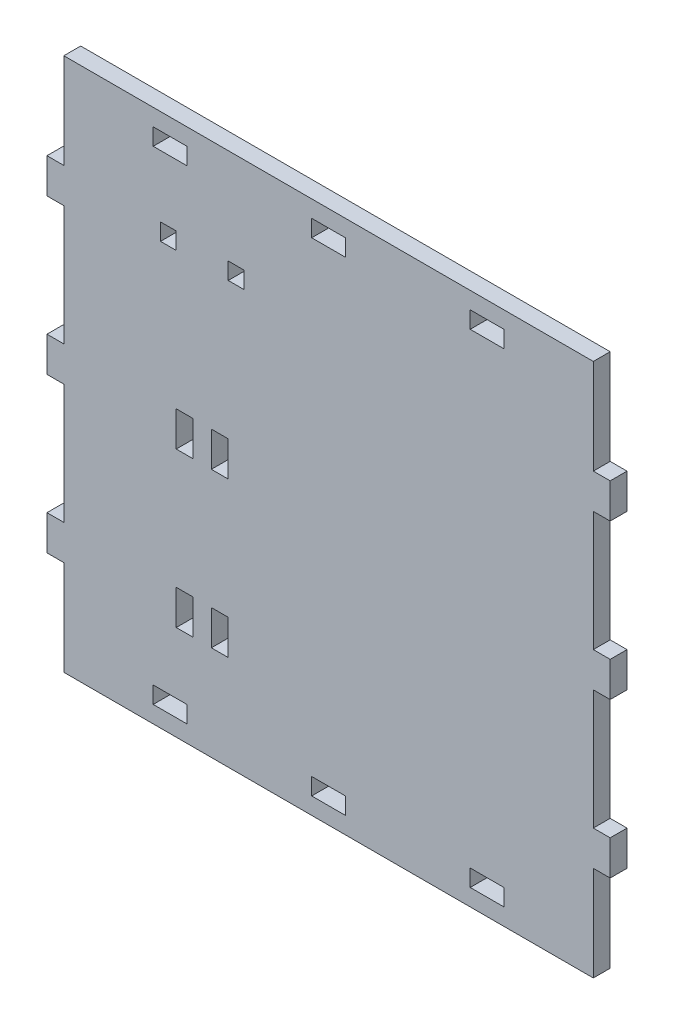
ISO-10303-21;
HEADER;
FILE_DESCRIPTION(('STEP AP214'),'2;1');
FILE_NAME('part.step','',(''),(''),'','','');
FILE_SCHEMA(('AUTOMOTIVE_DESIGN { 1 0 10303 214 1 1 1 1 }'));
ENDSEC;
DATA;
#1=APPLICATION_CONTEXT('core data for automotive mechanical design processes');
#2=APPLICATION_PROTOCOL_DEFINITION('international standard','automotive_design',2000,#1);
#3=PRODUCT_CONTEXT('',#1,'mechanical');
#4=PRODUCT('Part','Part','',(#3));
#5=PRODUCT_RELATED_PRODUCT_CATEGORY('part','',(#4));
#6=PRODUCT_DEFINITION_FORMATION('','',#4);
#7=PRODUCT_DEFINITION_CONTEXT('part definition',#1,'design');
#8=PRODUCT_DEFINITION('design','',#6,#7);
#9=PRODUCT_DEFINITION_SHAPE('','',#8);
#10=(LENGTH_UNIT() NAMED_UNIT(*) SI_UNIT(.MILLI.,.METRE.));
#11=(NAMED_UNIT(*) PLANE_ANGLE_UNIT() SI_UNIT($,.RADIAN.));
#12=(NAMED_UNIT(*) SI_UNIT($,.STERADIAN.) SOLID_ANGLE_UNIT());
#13=UNCERTAINTY_MEASURE_WITH_UNIT(LENGTH_MEASURE(1.E-05),#10,'distance_accuracy_value','');
#14=(GEOMETRIC_REPRESENTATION_CONTEXT(3) GLOBAL_UNCERTAINTY_ASSIGNED_CONTEXT((#13)) GLOBAL_UNIT_ASSIGNED_CONTEXT((#10,
#11,#12)) REPRESENTATION_CONTEXT('',''));
#15=CARTESIAN_POINT('',(0.,0.,0.));
#16=DIRECTION('',(0.,0.,1.));
#17=DIRECTION('',(1.,0.,0.));
#18=AXIS2_PLACEMENT_3D('',#15,#16,#17);
#19=CARTESIAN_POINT('',(47.1,0.,3.));
#20=DIRECTION('',(1.,0.,0.));
#21=DIRECTION('',(0.,0.,-1.));
#22=AXIS2_PLACEMENT_3D('',#19,#20,#21);
#23=PLANE('',#22);
#24=DIRECTION('',(0.,-1.,0.));
#25=VECTOR('',#24,1.);
#26=CARTESIAN_POINT('',(47.1,0.,0.));
#27=LINE('',#26,#25);
#28=CARTESIAN_POINT('',(47.1,3.,0.));
#29=VERTEX_POINT('',#28);
#30=CARTESIAN_POINT('',(47.1,-13.9,0.));
#31=VERTEX_POINT('',#30);
#32=EDGE_CURVE('E1039',#29,#31,#27,.T.);
#33=ORIENTED_EDGE('',*,*,#32,.F.);
#34=DIRECTION('',(0.,0.,-1.));
#35=VECTOR('',#34,1.);
#36=CARTESIAN_POINT('',(47.1,3.,3.));
#37=LINE('',#36,#35);
#38=CARTESIAN_POINT('',(47.1,3.,3.));
#39=VERTEX_POINT('',#38);
#40=EDGE_CURVE('E11',#39,#29,#37,.T.);
#41=ORIENTED_EDGE('',*,*,#40,.F.);
#42=DIRECTION('',(0.,-1.,0.));
#43=VECTOR('',#42,1.);
#44=CARTESIAN_POINT('',(47.1,0.,3.));
#45=LINE('',#44,#43);
#46=CARTESIAN_POINT('',(47.1,-13.9,3.));
#47=VERTEX_POINT('',#46);
#48=EDGE_CURVE('E855',#39,#47,#45,.T.);
#49=ORIENTED_EDGE('',*,*,#48,.T.);
#50=DIRECTION('',(0.,0.,-1.));
#51=VECTOR('',#50,1.);
#52=CARTESIAN_POINT('',(47.1,-13.9,3.));
#53=LINE('',#52,#51);
#54=EDGE_CURVE('E1132',#47,#31,#53,.T.);
#55=ORIENTED_EDGE('',*,*,#54,.T.);
#56=EDGE_LOOP('',(#33,#41,#49,#55));
#57=FACE_BOUND('',#56,.T.);
#58=ADVANCED_FACE('F17',(#57),#23,.T.);
#59=CARTESIAN_POINT('',(0.,3.,3.));
#60=DIRECTION('',(0.,-1.,0.));
#61=DIRECTION('',(1.,0.,0.));
#62=AXIS2_PLACEMENT_3D('',#59,#60,#61);
#63=PLANE('',#62);
#64=DIRECTION('',(-1.,0.,0.));
#65=VECTOR('',#64,1.);
#66=CARTESIAN_POINT('',(0.,3.,0.));
#67=LINE('',#66,#65);
#68=CARTESIAN_POINT('',(-47.1,3.,0.));
#69=VERTEX_POINT('',#68);
#70=EDGE_CURVE('E1043',#29,#69,#67,.T.);
#71=ORIENTED_EDGE('',*,*,#70,.T.);
#72=DIRECTION('',(0.,0.,-1.));
#73=VECTOR('',#72,1.);
#74=CARTESIAN_POINT('',(-47.1,3.,3.));
#75=LINE('',#74,#73);
#76=CARTESIAN_POINT('',(-47.1,3.,3.));
#77=VERTEX_POINT('',#76);
#78=EDGE_CURVE('E27',#77,#69,#75,.T.);
#79=ORIENTED_EDGE('',*,*,#78,.F.);
#80=DIRECTION('',(-1.,0.,0.));
#81=VECTOR('',#80,1.);
#82=CARTESIAN_POINT('',(0.,3.,3.));
#83=LINE('',#82,#81);
#84=EDGE_CURVE('E859',#39,#77,#83,.T.);
#85=ORIENTED_EDGE('',*,*,#84,.F.);
#86=ORIENTED_EDGE('',*,*,#40,.T.);
#87=EDGE_LOOP('',(#71,#79,#85,#86));
#88=FACE_BOUND('',#87,.T.);
#89=ADVANCED_FACE('F1342',(#88),#63,.F.);
#90=CARTESIAN_POINT('',(-47.1,0.,3.));
#91=DIRECTION('',(1.,0.,0.));
#92=DIRECTION('',(0.,0.,-1.));
#93=AXIS2_PLACEMENT_3D('',#90,#91,#92);
#94=PLANE('',#93);
#95=DIRECTION('',(0.,-1.,0.));
#96=VECTOR('',#95,1.);
#97=CARTESIAN_POINT('',(-47.1,0.,0.));
#98=LINE('',#97,#96);
#99=CARTESIAN_POINT('',(-47.1,-13.9,0.));
#100=VERTEX_POINT('',#99);
#101=EDGE_CURVE('E1049',#69,#100,#98,.T.);
#102=ORIENTED_EDGE('',*,*,#101,.T.);
#103=DIRECTION('',(0.,0.,-1.));
#104=VECTOR('',#103,1.);
#105=CARTESIAN_POINT('',(-47.1,-13.9,3.));
#106=LINE('',#105,#104);
#107=CARTESIAN_POINT('',(-47.1,-13.9,3.));
#108=VERTEX_POINT('',#107);
#109=EDGE_CURVE('E1215',#108,#100,#106,.T.);
#110=ORIENTED_EDGE('',*,*,#109,.F.);
#111=DIRECTION('',(0.,-1.,0.));
#112=VECTOR('',#111,1.);
#113=CARTESIAN_POINT('',(-47.1,0.,3.));
#114=LINE('',#113,#112);
#115=EDGE_CURVE('E865',#77,#108,#114,.T.);
#116=ORIENTED_EDGE('',*,*,#115,.F.);
#117=ORIENTED_EDGE('',*,*,#78,.T.);
#118=EDGE_LOOP('',(#102,#110,#116,#117));
#119=FACE_BOUND('',#118,.T.);
#120=ADVANCED_FACE('F1344',(#119),#94,.F.);
#121=CARTESIAN_POINT('',(0.,-13.9,3.));
#122=DIRECTION('',(0.,1.,0.));
#123=DIRECTION('',(-1.,0.,0.));
#124=AXIS2_PLACEMENT_3D('',#121,#122,#123);
#125=PLANE('',#124);
#126=DIRECTION('',(1.,0.,0.));
#127=VECTOR('',#126,1.);
#128=CARTESIAN_POINT('',(0.,-13.9,0.));
#129=LINE('',#128,#127);
#130=CARTESIAN_POINT('',(-50.1,-13.9,0.));
#131=VERTEX_POINT('',#130);
#132=EDGE_CURVE('E1053',#131,#100,#129,.T.);
#133=ORIENTED_EDGE('',*,*,#132,.F.);
#134=DIRECTION('',(0.,0.,-1.));
#135=VECTOR('',#134,1.);
#136=CARTESIAN_POINT('',(-50.1,-13.9,3.));
#137=LINE('',#136,#135);
#138=CARTESIAN_POINT('',(-50.1,-13.9,3.));
#139=VERTEX_POINT('',#138);
#140=EDGE_CURVE('E1212',#139,#131,#137,.T.);
#141=ORIENTED_EDGE('',*,*,#140,.F.);
#142=DIRECTION('',(1.,0.,0.));
#143=VECTOR('',#142,1.);
#144=CARTESIAN_POINT('',(0.,-13.9,3.));
#145=LINE('',#144,#143);
#146=EDGE_CURVE('E868',#139,#108,#145,.T.);
#147=ORIENTED_EDGE('',*,*,#146,.T.);
#148=ORIENTED_EDGE('',*,*,#109,.T.);
#149=EDGE_LOOP('',(#133,#141,#147,#148));
#150=FACE_BOUND('',#149,.T.);
#151=ADVANCED_FACE('F1513',(#150),#125,.T.);
#152=CARTESIAN_POINT('',(-50.1,0.,3.));
#153=DIRECTION('',(-1.,0.,0.));
#154=DIRECTION('',(0.,-1.,0.));
#155=AXIS2_PLACEMENT_3D('',#152,#153,#154);
#156=PLANE('',#155);
#157=DIRECTION('',(0.,1.,0.));
#158=VECTOR('',#157,1.);
#159=CARTESIAN_POINT('',(-50.1,0.,0.));
#160=LINE('',#159,#158);
#161=CARTESIAN_POINT('',(-50.1,-20.1,0.));
#162=VERTEX_POINT('',#161);
#163=EDGE_CURVE('E1059',#162,#131,#160,.T.);
#164=ORIENTED_EDGE('',*,*,#163,.F.);
#165=DIRECTION('',(0.,0.,-1.));
#166=VECTOR('',#165,1.);
#167=CARTESIAN_POINT('',(-50.1,-20.1,3.));
#168=LINE('',#167,#166);
#169=CARTESIAN_POINT('',(-50.1,-20.1,3.));
#170=VERTEX_POINT('',#169);
#171=EDGE_CURVE('E1209',#170,#162,#168,.T.);
#172=ORIENTED_EDGE('',*,*,#171,.F.);
#173=DIRECTION('',(0.,1.,0.));
#174=VECTOR('',#173,1.);
#175=CARTESIAN_POINT('',(-50.1,0.,3.));
#176=LINE('',#175,#174);
#177=EDGE_CURVE('E874',#170,#139,#176,.T.);
#178=ORIENTED_EDGE('',*,*,#177,.T.);
#179=ORIENTED_EDGE('',*,*,#140,.T.);
#180=EDGE_LOOP('',(#164,#172,#178,#179));
#181=FACE_BOUND('',#180,.T.);
#182=ADVANCED_FACE('F1351',(#181),#156,.T.);
#183=CARTESIAN_POINT('',(0.,-20.1,3.));
#184=DIRECTION('',(0.,1.,0.));
#185=DIRECTION('',(-1.,0.,0.));
#186=AXIS2_PLACEMENT_3D('',#183,#184,#185);
#187=PLANE('',#186);
#188=DIRECTION('',(1.,0.,0.));
#189=VECTOR('',#188,1.);
#190=CARTESIAN_POINT('',(0.,-20.1,0.));
#191=LINE('',#190,#189);
#192=CARTESIAN_POINT('',(-47.1,-20.1,0.));
#193=VERTEX_POINT('',#192);
#194=EDGE_CURVE('E1063',#162,#193,#191,.T.);
#195=ORIENTED_EDGE('',*,*,#194,.T.);
#196=DIRECTION('',(0.,0.,-1.));
#197=VECTOR('',#196,1.);
#198=CARTESIAN_POINT('',(-47.1,-20.1,3.));
#199=LINE('',#198,#197);
#200=CARTESIAN_POINT('',(-47.1,-20.1,3.));
#201=VERTEX_POINT('',#200);
#202=EDGE_CURVE('E1205',#201,#193,#199,.T.);
#203=ORIENTED_EDGE('',*,*,#202,.F.);
#204=DIRECTION('',(1.,0.,0.));
#205=VECTOR('',#204,1.);
#206=CARTESIAN_POINT('',(0.,-20.1,3.));
#207=LINE('',#206,#205);
#208=EDGE_CURVE('E878',#170,#201,#207,.T.);
#209=ORIENTED_EDGE('',*,*,#208,.F.);
#210=ORIENTED_EDGE('',*,*,#171,.T.);
#211=EDGE_LOOP('',(#195,#203,#209,#210));
#212=FACE_BOUND('',#211,.T.);
#213=ADVANCED_FACE('F1357',(#212),#187,.F.);
#214=CARTESIAN_POINT('',(-47.1,-41.4,0.));
#215=VERTEX_POINT('',#214);
#216=EDGE_CURVE('E1055',#193,#215,#98,.T.);
#217=ORIENTED_EDGE('',*,*,#216,.T.);
#218=DIRECTION('',(0.,0.,-1.));
#219=VECTOR('',#218,1.);
#220=CARTESIAN_POINT('',(-47.1,-41.4,3.));
#221=LINE('',#220,#219);
#222=CARTESIAN_POINT('',(-47.1,-41.4,3.));
#223=VERTEX_POINT('',#222);
#224=EDGE_CURVE('E1202',#223,#215,#221,.T.);
#225=ORIENTED_EDGE('',*,*,#224,.F.);
#226=EDGE_CURVE('E870',#201,#223,#114,.T.);
#227=ORIENTED_EDGE('',*,*,#226,.F.);
#228=ORIENTED_EDGE('',*,*,#202,.T.);
#229=EDGE_LOOP('',(#217,#225,#227,#228));
#230=FACE_BOUND('',#229,.T.);
#231=ADVANCED_FACE('F1364',(#230),#94,.F.);
#232=CARTESIAN_POINT('',(0.,-41.4,3.));
#233=DIRECTION('',(0.,1.,0.));
#234=DIRECTION('',(0.,0.,1.));
#235=AXIS2_PLACEMENT_3D('',#232,#233,#234);
#236=PLANE('',#235);
#237=DIRECTION('',(1.,0.,0.));
#238=VECTOR('',#237,1.);
#239=CARTESIAN_POINT('',(0.,-41.4,0.));
#240=LINE('',#239,#238);
#241=CARTESIAN_POINT('',(-50.1,-41.4,0.));
#242=VERTEX_POINT('',#241);
#243=EDGE_CURVE('E1067',#242,#215,#240,.T.);
#244=ORIENTED_EDGE('',*,*,#243,.F.);
#245=DIRECTION('',(0.,0.,-1.));
#246=VECTOR('',#245,1.);
#247=CARTESIAN_POINT('',(-50.1,-41.4,3.));
#248=LINE('',#247,#246);
#249=CARTESIAN_POINT('',(-50.1,-41.4,3.));
#250=VERTEX_POINT('',#249);
#251=EDGE_CURVE('E1199',#250,#242,#248,.T.);
#252=ORIENTED_EDGE('',*,*,#251,.F.);
#253=DIRECTION('',(1.,0.,0.));
#254=VECTOR('',#253,1.);
#255=CARTESIAN_POINT('',(0.,-41.4,3.));
#256=LINE('',#255,#254);
#257=EDGE_CURVE('E882',#250,#223,#256,.T.);
#258=ORIENTED_EDGE('',*,*,#257,.T.);
#259=ORIENTED_EDGE('',*,*,#224,.T.);
#260=EDGE_LOOP('',(#244,#252,#258,#259));
#261=FACE_BOUND('',#260,.T.);
#262=ADVANCED_FACE('F1367',(#261),#236,.T.);
#263=CARTESIAN_POINT('',(-50.1,0.,3.));
#264=DIRECTION('',(-1.,0.,0.));
#265=DIRECTION('',(0.,0.,1.));
#266=AXIS2_PLACEMENT_3D('',#263,#264,#265);
#267=PLANE('',#266);
#268=DIRECTION('',(0.,1.,0.));
#269=VECTOR('',#268,1.);
#270=CARTESIAN_POINT('',(-50.1,0.,0.));
#271=LINE('',#270,#269);
#272=CARTESIAN_POINT('',(-50.1,-47.6,0.));
#273=VERTEX_POINT('',#272);
#274=EDGE_CURVE('E1071',#273,#242,#271,.T.);
#275=ORIENTED_EDGE('',*,*,#274,.F.);
#276=DIRECTION('',(0.,0.,-1.));
#277=VECTOR('',#276,1.);
#278=CARTESIAN_POINT('',(-50.1,-47.6,3.));
#279=LINE('',#278,#277);
#280=CARTESIAN_POINT('',(-50.1,-47.6,3.));
#281=VERTEX_POINT('',#280);
#282=EDGE_CURVE('E1196',#281,#273,#279,.T.);
#283=ORIENTED_EDGE('',*,*,#282,.F.);
#284=DIRECTION('',(0.,1.,0.));
#285=VECTOR('',#284,1.);
#286=CARTESIAN_POINT('',(-50.1,0.,3.));
#287=LINE('',#286,#285);
#288=EDGE_CURVE('E886',#281,#250,#287,.T.);
#289=ORIENTED_EDGE('',*,*,#288,.T.);
#290=ORIENTED_EDGE('',*,*,#251,.T.);
#291=EDGE_LOOP('',(#275,#283,#289,#290));
#292=FACE_BOUND('',#291,.T.);
#293=ADVANCED_FACE('F1370',(#292),#267,.T.);
#294=CARTESIAN_POINT('',(0.,-47.6,3.));
#295=DIRECTION('',(0.,1.,0.));
#296=DIRECTION('',(0.,0.,1.));
#297=AXIS2_PLACEMENT_3D('',#294,#295,#296);
#298=PLANE('',#297);
#299=DIRECTION('',(1.,0.,0.));
#300=VECTOR('',#299,1.);
#301=CARTESIAN_POINT('',(0.,-47.6,0.));
#302=LINE('',#301,#300);
#303=CARTESIAN_POINT('',(-47.1,-47.6,0.));
#304=VERTEX_POINT('',#303);
#305=EDGE_CURVE('E1075',#273,#304,#302,.T.);
#306=ORIENTED_EDGE('',*,*,#305,.T.);
#307=DIRECTION('',(0.,0.,-1.));
#308=VECTOR('',#307,1.);
#309=CARTESIAN_POINT('',(-47.1,-47.6,3.));
#310=LINE('',#309,#308);
#311=CARTESIAN_POINT('',(-47.1,-47.6,3.));
#312=VERTEX_POINT('',#311);
#313=EDGE_CURVE('E1192',#312,#304,#310,.T.);
#314=ORIENTED_EDGE('',*,*,#313,.F.);
#315=DIRECTION('',(1.,0.,0.));
#316=VECTOR('',#315,1.);
#317=CARTESIAN_POINT('',(0.,-47.6,3.));
#318=LINE('',#317,#316);
#319=EDGE_CURVE('E890',#281,#312,#318,.T.);
#320=ORIENTED_EDGE('',*,*,#319,.F.);
#321=ORIENTED_EDGE('',*,*,#282,.T.);
#322=EDGE_LOOP('',(#306,#314,#320,#321));
#323=FACE_BOUND('',#322,.T.);
#324=ADVANCED_FACE('F1376',(#323),#298,.F.);
#325=CARTESIAN_POINT('',(-47.1,-68.9,0.));
#326=VERTEX_POINT('',#325);
#327=EDGE_CURVE('E1079',#304,#326,#98,.T.);
#328=ORIENTED_EDGE('',*,*,#327,.T.);
#329=DIRECTION('',(0.,0.,-1.));
#330=VECTOR('',#329,1.);
#331=CARTESIAN_POINT('',(-47.1,-68.9,3.));
#332=LINE('',#331,#330);
#333=CARTESIAN_POINT('',(-47.1,-68.9,3.));
#334=VERTEX_POINT('',#333);
#335=EDGE_CURVE('E1189',#334,#326,#332,.T.);
#336=ORIENTED_EDGE('',*,*,#335,.F.);
#337=EDGE_CURVE('E894',#312,#334,#114,.T.);
#338=ORIENTED_EDGE('',*,*,#337,.F.);
#339=ORIENTED_EDGE('',*,*,#313,.T.);
#340=EDGE_LOOP('',(#328,#336,#338,#339));
#341=FACE_BOUND('',#340,.T.);
#342=ADVANCED_FACE('F1380',(#341),#94,.F.);
#343=CARTESIAN_POINT('',(0.,-68.9,3.));
#344=DIRECTION('',(0.,1.,0.));
#345=DIRECTION('',(0.,0.,1.));
#346=AXIS2_PLACEMENT_3D('',#343,#344,#345);
#347=PLANE('',#346);
#348=DIRECTION('',(1.,0.,0.));
#349=VECTOR('',#348,1.);
#350=CARTESIAN_POINT('',(0.,-68.9,0.));
#351=LINE('',#350,#349);
#352=CARTESIAN_POINT('',(-50.1,-68.9,0.));
#353=VERTEX_POINT('',#352);
#354=EDGE_CURVE('E1080',#353,#326,#351,.T.);
#355=ORIENTED_EDGE('',*,*,#354,.F.);
#356=DIRECTION('',(0.,0.,-1.));
#357=VECTOR('',#356,1.);
#358=CARTESIAN_POINT('',(-50.1,-68.9,3.));
#359=LINE('',#358,#357);
#360=CARTESIAN_POINT('',(-50.1,-68.9,3.));
#361=VERTEX_POINT('',#360);
#362=EDGE_CURVE('E1186',#361,#353,#359,.T.);
#363=ORIENTED_EDGE('',*,*,#362,.F.);
#364=DIRECTION('',(1.,0.,0.));
#365=VECTOR('',#364,1.);
#366=CARTESIAN_POINT('',(0.,-68.9,3.));
#367=LINE('',#366,#365);
#368=EDGE_CURVE('E895',#361,#334,#367,.T.);
#369=ORIENTED_EDGE('',*,*,#368,.T.);
#370=ORIENTED_EDGE('',*,*,#335,.T.);
#371=EDGE_LOOP('',(#355,#363,#369,#370));
#372=FACE_BOUND('',#371,.T.);
#373=ADVANCED_FACE('F1498',(#372),#347,.T.);
#374=CARTESIAN_POINT('',(-50.1,0.,3.));
#375=DIRECTION('',(-1.,0.,0.));
#376=DIRECTION('',(0.,0.,1.));
#377=AXIS2_PLACEMENT_3D('',#374,#375,#376);
#378=PLANE('',#377);
#379=DIRECTION('',(0.,1.,0.));
#380=VECTOR('',#379,1.);
#381=CARTESIAN_POINT('',(-50.1,0.,0.));
#382=LINE('',#381,#380);
#383=CARTESIAN_POINT('',(-50.1,-75.1,0.));
#384=VERTEX_POINT('',#383);
#385=EDGE_CURVE('E1084',#384,#353,#382,.T.);
#386=ORIENTED_EDGE('',*,*,#385,.F.);
#387=DIRECTION('',(0.,0.,-1.));
#388=VECTOR('',#387,1.);
#389=CARTESIAN_POINT('',(-50.1,-75.1,3.));
#390=LINE('',#389,#388);
#391=CARTESIAN_POINT('',(-50.1,-75.1,3.));
#392=VERTEX_POINT('',#391);
#393=EDGE_CURVE('E1183',#392,#384,#390,.T.);
#394=ORIENTED_EDGE('',*,*,#393,.F.);
#395=DIRECTION('',(0.,1.,0.));
#396=VECTOR('',#395,1.);
#397=CARTESIAN_POINT('',(-50.1,0.,3.));
#398=LINE('',#397,#396);
#399=EDGE_CURVE('E899',#392,#361,#398,.T.);
#400=ORIENTED_EDGE('',*,*,#399,.T.);
#401=ORIENTED_EDGE('',*,*,#362,.T.);
#402=EDGE_LOOP('',(#386,#394,#400,#401));
#403=FACE_BOUND('',#402,.T.);
#404=ADVANCED_FACE('F1494',(#403),#378,.T.);
#405=CARTESIAN_POINT('',(0.,-75.1,3.));
#406=DIRECTION('',(0.,1.,0.));
#407=DIRECTION('',(0.,0.,1.));
#408=AXIS2_PLACEMENT_3D('',#405,#406,#407);
#409=PLANE('',#408);
#410=DIRECTION('',(1.,0.,0.));
#411=VECTOR('',#410,1.);
#412=CARTESIAN_POINT('',(0.,-75.1,0.));
#413=LINE('',#412,#411);
#414=CARTESIAN_POINT('',(-47.1,-75.1,0.));
#415=VERTEX_POINT('',#414);
#416=EDGE_CURVE('E1088',#384,#415,#413,.T.);
#417=ORIENTED_EDGE('',*,*,#416,.T.);
#418=DIRECTION('',(0.,0.,-1.));
#419=VECTOR('',#418,1.);
#420=CARTESIAN_POINT('',(-47.1,-75.1,3.));
#421=LINE('',#420,#419);
#422=CARTESIAN_POINT('',(-47.1,-75.1,3.));
#423=VERTEX_POINT('',#422);
#424=EDGE_CURVE('E1179',#423,#415,#421,.T.);
#425=ORIENTED_EDGE('',*,*,#424,.F.);
#426=DIRECTION('',(1.,0.,0.));
#427=VECTOR('',#426,1.);
#428=CARTESIAN_POINT('',(0.,-75.1,3.));
#429=LINE('',#428,#427);
#430=EDGE_CURVE('E903',#392,#423,#429,.T.);
#431=ORIENTED_EDGE('',*,*,#430,.F.);
#432=ORIENTED_EDGE('',*,*,#393,.T.);
#433=EDGE_LOOP('',(#417,#425,#431,#432));
#434=FACE_BOUND('',#433,.T.);
#435=ADVANCED_FACE('F1491',(#434),#409,.F.);
#436=CARTESIAN_POINT('',(-47.1,-92.,0.));
#437=VERTEX_POINT('',#436);
#438=EDGE_CURVE('E1054',#415,#437,#98,.T.);
#439=ORIENTED_EDGE('',*,*,#438,.T.);
#440=DIRECTION('',(0.,0.,-1.));
#441=VECTOR('',#440,1.);
#442=CARTESIAN_POINT('',(-47.1,-92.,3.));
#443=LINE('',#442,#441);
#444=CARTESIAN_POINT('',(-47.1,-92.,3.));
#445=VERTEX_POINT('',#444);
#446=EDGE_CURVE('E1175',#445,#437,#443,.T.);
#447=ORIENTED_EDGE('',*,*,#446,.F.);
#448=EDGE_CURVE('E869',#423,#445,#114,.T.);
#449=ORIENTED_EDGE('',*,*,#448,.F.);
#450=ORIENTED_EDGE('',*,*,#424,.T.);
#451=EDGE_LOOP('',(#439,#447,#449,#450));
#452=FACE_BOUND('',#451,.T.);
#453=ADVANCED_FACE('F1392',(#452),#94,.F.);
#454=CARTESIAN_POINT('',(0.,-92.,3.));
#455=DIRECTION('',(0.,1.,0.));
#456=DIRECTION('',(0.,0.,1.));
#457=AXIS2_PLACEMENT_3D('',#454,#455,#456);
#458=PLANE('',#457);
#459=DIRECTION('',(1.,0.,0.));
#460=VECTOR('',#459,1.);
#461=CARTESIAN_POINT('',(0.,-92.,0.));
#462=LINE('',#461,#460);
#463=CARTESIAN_POINT('',(47.1,-92.,0.));
#464=VERTEX_POINT('',#463);
#465=EDGE_CURVE('E1092',#437,#464,#462,.T.);
#466=ORIENTED_EDGE('',*,*,#465,.T.);
#467=DIRECTION('',(0.,0.,-1.));
#468=VECTOR('',#467,1.);
#469=CARTESIAN_POINT('',(47.1,-92.,3.));
#470=LINE('',#469,#468);
#471=CARTESIAN_POINT('',(47.1,-92.,3.));
#472=VERTEX_POINT('',#471);
#473=EDGE_CURVE('E1172',#472,#464,#470,.T.);
#474=ORIENTED_EDGE('',*,*,#473,.F.);
#475=DIRECTION('',(1.,0.,0.));
#476=VECTOR('',#475,1.);
#477=CARTESIAN_POINT('',(0.,-92.,3.));
#478=LINE('',#477,#476);
#479=EDGE_CURVE('E907',#445,#472,#478,.T.);
#480=ORIENTED_EDGE('',*,*,#479,.F.);
#481=ORIENTED_EDGE('',*,*,#446,.T.);
#482=EDGE_LOOP('',(#466,#474,#480,#481));
#483=FACE_BOUND('',#482,.T.);
#484=ADVANCED_FACE('F1394',(#483),#458,.F.);
#485=CARTESIAN_POINT('',(47.1,-75.1,0.));
#486=VERTEX_POINT('',#485);
#487=EDGE_CURVE('E1045',#486,#464,#27,.T.);
#488=ORIENTED_EDGE('',*,*,#487,.F.);
#489=DIRECTION('',(0.,0.,-1.));
#490=VECTOR('',#489,1.);
#491=CARTESIAN_POINT('',(47.1,-75.1,3.));
#492=LINE('',#491,#490);
#493=CARTESIAN_POINT('',(47.1,-75.1,3.));
#494=VERTEX_POINT('',#493);
#495=EDGE_CURVE('E1169',#494,#486,#492,.T.);
#496=ORIENTED_EDGE('',*,*,#495,.F.);
#497=EDGE_CURVE('E861',#494,#472,#45,.T.);
#498=ORIENTED_EDGE('',*,*,#497,.T.);
#499=ORIENTED_EDGE('',*,*,#473,.T.);
#500=EDGE_LOOP('',(#488,#496,#498,#499));
#501=FACE_BOUND('',#500,.T.);
#502=ADVANCED_FACE('F1399',(#501),#23,.T.);
#503=CARTESIAN_POINT('',(-3.47407288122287E-13,-75.1,3.));
#504=DIRECTION('',(0.,1.,0.));
#505=DIRECTION('',(-1.,0.,0.));
#506=AXIS2_PLACEMENT_3D('',#503,#504,#505);
#507=PLANE('',#506);
#508=DIRECTION('',(1.,0.,0.));
#509=VECTOR('',#508,1.);
#510=CARTESIAN_POINT('',(-3.47407288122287E-13,-75.1,0.));
#511=LINE('',#510,#509);
#512=CARTESIAN_POINT('',(50.1,-75.1,0.));
#513=VERTEX_POINT('',#512);
#514=EDGE_CURVE('E1096',#486,#513,#511,.T.);
#515=ORIENTED_EDGE('',*,*,#514,.T.);
#516=DIRECTION('',(0.,0.,-1.));
#517=VECTOR('',#516,1.);
#518=CARTESIAN_POINT('',(50.1,-75.1,3.));
#519=LINE('',#518,#517);
#520=CARTESIAN_POINT('',(50.1,-75.1,3.));
#521=VERTEX_POINT('',#520);
#522=EDGE_CURVE('E1165',#521,#513,#519,.T.);
#523=ORIENTED_EDGE('',*,*,#522,.F.);
#524=DIRECTION('',(1.,0.,0.));
#525=VECTOR('',#524,1.);
#526=CARTESIAN_POINT('',(-3.47407288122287E-13,-75.1,3.));
#527=LINE('',#526,#525);
#528=EDGE_CURVE('E910',#494,#521,#527,.T.);
#529=ORIENTED_EDGE('',*,*,#528,.F.);
#530=ORIENTED_EDGE('',*,*,#495,.T.);
#531=EDGE_LOOP('',(#515,#523,#529,#530));
#532=FACE_BOUND('',#531,.T.);
#533=ADVANCED_FACE('F1431',(#532),#507,.F.);
#534=CARTESIAN_POINT('',(50.1,0.,3.));
#535=DIRECTION('',(-1.,0.,0.));
#536=DIRECTION('',(0.,0.,1.));
#537=AXIS2_PLACEMENT_3D('',#534,#535,#536);
#538=PLANE('',#537);
#539=DIRECTION('',(0.,1.,0.));
#540=VECTOR('',#539,1.);
#541=CARTESIAN_POINT('',(50.1,0.,0.));
#542=LINE('',#541,#540);
#543=CARTESIAN_POINT('',(50.1,-68.9,0.));
#544=VERTEX_POINT('',#543);
#545=EDGE_CURVE('E1100',#513,#544,#542,.T.);
#546=ORIENTED_EDGE('',*,*,#545,.T.);
#547=DIRECTION('',(0.,0.,-1.));
#548=VECTOR('',#547,1.);
#549=CARTESIAN_POINT('',(50.1,-68.9,3.));
#550=LINE('',#549,#548);
#551=CARTESIAN_POINT('',(50.1,-68.9,3.));
#552=VERTEX_POINT('',#551);
#553=EDGE_CURVE('E1162',#552,#544,#550,.T.);
#554=ORIENTED_EDGE('',*,*,#553,.F.);
#555=DIRECTION('',(0.,1.,0.));
#556=VECTOR('',#555,1.);
#557=CARTESIAN_POINT('',(50.1,0.,3.));
#558=LINE('',#557,#556);
#559=EDGE_CURVE('E914',#521,#552,#558,.T.);
#560=ORIENTED_EDGE('',*,*,#559,.F.);
#561=ORIENTED_EDGE('',*,*,#522,.T.);
#562=EDGE_LOOP('',(#546,#554,#560,#561));
#563=FACE_BOUND('',#562,.T.);
#564=ADVANCED_FACE('F1435',(#563),#538,.F.);
#565=CARTESIAN_POINT('',(3.18726526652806E-13,-68.9,3.));
#566=DIRECTION('',(0.,1.,0.));
#567=DIRECTION('',(-1.,0.,0.));
#568=AXIS2_PLACEMENT_3D('',#565,#566,#567);
#569=PLANE('',#568);
#570=DIRECTION('',(1.,0.,0.));
#571=VECTOR('',#570,1.);
#572=CARTESIAN_POINT('',(3.18726526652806E-13,-68.9,0.));
#573=LINE('',#572,#571);
#574=CARTESIAN_POINT('',(47.1,-68.9,0.));
#575=VERTEX_POINT('',#574);
#576=EDGE_CURVE('E1104',#575,#544,#573,.T.);
#577=ORIENTED_EDGE('',*,*,#576,.F.);
#578=DIRECTION('',(0.,0.,-1.));
#579=VECTOR('',#578,1.);
#580=CARTESIAN_POINT('',(47.1,-68.9,3.));
#581=LINE('',#580,#579);
#582=CARTESIAN_POINT('',(47.1,-68.9,3.));
#583=VERTEX_POINT('',#582);
#584=EDGE_CURVE('E1159',#583,#575,#581,.T.);
#585=ORIENTED_EDGE('',*,*,#584,.F.);
#586=DIRECTION('',(1.,0.,0.));
#587=VECTOR('',#586,1.);
#588=CARTESIAN_POINT('',(3.18726526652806E-13,-68.9,3.));
#589=LINE('',#588,#587);
#590=EDGE_CURVE('E917',#583,#552,#589,.T.);
#591=ORIENTED_EDGE('',*,*,#590,.T.);
#592=ORIENTED_EDGE('',*,*,#553,.T.);
#593=EDGE_LOOP('',(#577,#585,#591,#592));
#594=FACE_BOUND('',#593,.T.);
#595=ADVANCED_FACE('F1438',(#594),#569,.T.);
#596=CARTESIAN_POINT('',(47.1,-47.6,0.));
#597=VERTEX_POINT('',#596);
#598=EDGE_CURVE('E1108',#597,#575,#27,.T.);
#599=ORIENTED_EDGE('',*,*,#598,.F.);
#600=DIRECTION('',(0.,0.,-1.));
#601=VECTOR('',#600,1.);
#602=CARTESIAN_POINT('',(47.1,-47.6,3.));
#603=LINE('',#602,#601);
#604=CARTESIAN_POINT('',(47.1,-47.6,3.));
#605=VERTEX_POINT('',#604);
#606=EDGE_CURVE('E1156',#605,#597,#603,.T.);
#607=ORIENTED_EDGE('',*,*,#606,.F.);
#608=EDGE_CURVE('E921',#605,#583,#45,.T.);
#609=ORIENTED_EDGE('',*,*,#608,.T.);
#610=ORIENTED_EDGE('',*,*,#584,.T.);
#611=EDGE_LOOP('',(#599,#607,#609,#610));
#612=FACE_BOUND('',#611,.T.);
#613=ADVANCED_FACE('F1439',(#612),#23,.T.);
#614=CARTESIAN_POINT('',(0.,-47.6,3.));
#615=DIRECTION('',(0.,1.,0.));
#616=DIRECTION('',(0.,0.,1.));
#617=AXIS2_PLACEMENT_3D('',#614,#615,#616);
#618=PLANE('',#617);
#619=DIRECTION('',(1.,0.,0.));
#620=VECTOR('',#619,1.);
#621=CARTESIAN_POINT('',(0.,-47.6,0.));
#622=LINE('',#621,#620);
#623=CARTESIAN_POINT('',(50.1,-47.6,0.));
#624=VERTEX_POINT('',#623);
#625=EDGE_CURVE('E1109',#597,#624,#622,.T.);
#626=ORIENTED_EDGE('',*,*,#625,.T.);
#627=DIRECTION('',(0.,0.,-1.));
#628=VECTOR('',#627,1.);
#629=CARTESIAN_POINT('',(50.1,-47.6,3.));
#630=LINE('',#629,#628);
#631=CARTESIAN_POINT('',(50.1,-47.6,3.));
#632=VERTEX_POINT('',#631);
#633=EDGE_CURVE('E1152',#632,#624,#630,.T.);
#634=ORIENTED_EDGE('',*,*,#633,.F.);
#635=DIRECTION('',(1.,0.,0.));
#636=VECTOR('',#635,1.);
#637=CARTESIAN_POINT('',(0.,-47.6,3.));
#638=LINE('',#637,#636);
#639=EDGE_CURVE('E922',#605,#632,#638,.T.);
#640=ORIENTED_EDGE('',*,*,#639,.F.);
#641=ORIENTED_EDGE('',*,*,#606,.T.);
#642=EDGE_LOOP('',(#626,#634,#640,#641));
#643=FACE_BOUND('',#642,.T.);
#644=ADVANCED_FACE('F1443',(#643),#618,.F.);
#645=CARTESIAN_POINT('',(50.1,0.,3.));
#646=DIRECTION('',(-1.,0.,0.));
#647=DIRECTION('',(0.,0.,1.));
#648=AXIS2_PLACEMENT_3D('',#645,#646,#647);
#649=PLANE('',#648);
#650=DIRECTION('',(0.,1.,0.));
#651=VECTOR('',#650,1.);
#652=CARTESIAN_POINT('',(50.1,0.,0.));
#653=LINE('',#652,#651);
#654=CARTESIAN_POINT('',(50.1,-41.4,0.));
#655=VERTEX_POINT('',#654);
#656=EDGE_CURVE('E1113',#624,#655,#653,.T.);
#657=ORIENTED_EDGE('',*,*,#656,.T.);
#658=DIRECTION('',(0.,0.,-1.));
#659=VECTOR('',#658,1.);
#660=CARTESIAN_POINT('',(50.1,-41.4,3.));
#661=LINE('',#660,#659);
#662=CARTESIAN_POINT('',(50.1,-41.4,3.));
#663=VERTEX_POINT('',#662);
#664=EDGE_CURVE('E1149',#663,#655,#661,.T.);
#665=ORIENTED_EDGE('',*,*,#664,.F.);
#666=DIRECTION('',(0.,1.,0.));
#667=VECTOR('',#666,1.);
#668=CARTESIAN_POINT('',(50.1,0.,3.));
#669=LINE('',#668,#667);
#670=EDGE_CURVE('E926',#632,#663,#669,.T.);
#671=ORIENTED_EDGE('',*,*,#670,.F.);
#672=ORIENTED_EDGE('',*,*,#633,.T.);
#673=EDGE_LOOP('',(#657,#665,#671,#672));
#674=FACE_BOUND('',#673,.T.);
#675=ADVANCED_FACE('F1445',(#674),#649,.F.);
#676=CARTESIAN_POINT('',(0.,-41.4,3.));
#677=DIRECTION('',(0.,1.,0.));
#678=DIRECTION('',(0.,0.,1.));
#679=AXIS2_PLACEMENT_3D('',#676,#677,#678);
#680=PLANE('',#679);
#681=DIRECTION('',(1.,0.,0.));
#682=VECTOR('',#681,1.);
#683=CARTESIAN_POINT('',(0.,-41.4,0.));
#684=LINE('',#683,#682);
#685=CARTESIAN_POINT('',(47.1,-41.4,0.));
#686=VERTEX_POINT('',#685);
#687=EDGE_CURVE('E1117',#686,#655,#684,.T.);
#688=ORIENTED_EDGE('',*,*,#687,.F.);
#689=DIRECTION('',(0.,0.,-1.));
#690=VECTOR('',#689,1.);
#691=CARTESIAN_POINT('',(47.1,-41.4,3.));
#692=LINE('',#691,#690);
#693=CARTESIAN_POINT('',(47.1,-41.4,3.));
#694=VERTEX_POINT('',#693);
#695=EDGE_CURVE('E1146',#694,#686,#692,.T.);
#696=ORIENTED_EDGE('',*,*,#695,.F.);
#697=DIRECTION('',(1.,0.,0.));
#698=VECTOR('',#697,1.);
#699=CARTESIAN_POINT('',(0.,-41.4,3.));
#700=LINE('',#699,#698);
#701=EDGE_CURVE('E929',#694,#663,#700,.T.);
#702=ORIENTED_EDGE('',*,*,#701,.T.);
#703=ORIENTED_EDGE('',*,*,#664,.T.);
#704=EDGE_LOOP('',(#688,#696,#702,#703));
#705=FACE_BOUND('',#704,.T.);
#706=ADVANCED_FACE('F1418',(#705),#680,.T.);
#707=CARTESIAN_POINT('',(47.1,-20.1,0.));
#708=VERTEX_POINT('',#707);
#709=EDGE_CURVE('E1044',#708,#686,#27,.T.);
#710=ORIENTED_EDGE('',*,*,#709,.F.);
#711=DIRECTION('',(0.,0.,-1.));
#712=VECTOR('',#711,1.);
#713=CARTESIAN_POINT('',(47.1,-20.1,3.));
#714=LINE('',#713,#712);
#715=CARTESIAN_POINT('',(47.1,-20.1,3.));
#716=VERTEX_POINT('',#715);
#717=EDGE_CURVE('E1143',#716,#708,#714,.T.);
#718=ORIENTED_EDGE('',*,*,#717,.F.);
#719=EDGE_CURVE('E860',#716,#694,#45,.T.);
#720=ORIENTED_EDGE('',*,*,#719,.T.);
#721=ORIENTED_EDGE('',*,*,#695,.T.);
#722=EDGE_LOOP('',(#710,#718,#720,#721));
#723=FACE_BOUND('',#722,.T.);
#724=ADVANCED_FACE('F1411',(#723),#23,.T.);
#725=CARTESIAN_POINT('',(0.,-20.1,3.));
#726=DIRECTION('',(0.,1.,0.));
#727=DIRECTION('',(0.,0.,1.));
#728=AXIS2_PLACEMENT_3D('',#725,#726,#727);
#729=PLANE('',#728);
#730=DIRECTION('',(1.,0.,0.));
#731=VECTOR('',#730,1.);
#732=CARTESIAN_POINT('',(0.,-20.1,0.));
#733=LINE('',#732,#731);
#734=CARTESIAN_POINT('',(50.1,-20.1,0.));
#735=VERTEX_POINT('',#734);
#736=EDGE_CURVE('E1121',#708,#735,#733,.T.);
#737=ORIENTED_EDGE('',*,*,#736,.T.);
#738=DIRECTION('',(0.,0.,-1.));
#739=VECTOR('',#738,1.);
#740=CARTESIAN_POINT('',(50.1,-20.1,3.));
#741=LINE('',#740,#739);
#742=CARTESIAN_POINT('',(50.1,-20.1,3.));
#743=VERTEX_POINT('',#742);
#744=EDGE_CURVE('E1139',#743,#735,#741,.T.);
#745=ORIENTED_EDGE('',*,*,#744,.F.);
#746=DIRECTION('',(1.,0.,0.));
#747=VECTOR('',#746,1.);
#748=CARTESIAN_POINT('',(0.,-20.1,3.));
#749=LINE('',#748,#747);
#750=EDGE_CURVE('E933',#716,#743,#749,.T.);
#751=ORIENTED_EDGE('',*,*,#750,.F.);
#752=ORIENTED_EDGE('',*,*,#717,.T.);
#753=EDGE_LOOP('',(#737,#745,#751,#752));
#754=FACE_BOUND('',#753,.T.);
#755=ADVANCED_FACE('F1466',(#754),#729,.F.);
#756=CARTESIAN_POINT('',(50.1,0.,3.));
#757=DIRECTION('',(-1.,0.,0.));
#758=DIRECTION('',(0.,0.,1.));
#759=AXIS2_PLACEMENT_3D('',#756,#757,#758);
#760=PLANE('',#759);
#761=DIRECTION('',(0.,1.,0.));
#762=VECTOR('',#761,1.);
#763=CARTESIAN_POINT('',(50.1,0.,0.));
#764=LINE('',#763,#762);
#765=CARTESIAN_POINT('',(50.1,-13.9,0.));
#766=VERTEX_POINT('',#765);
#767=EDGE_CURVE('E1125',#735,#766,#764,.T.);
#768=ORIENTED_EDGE('',*,*,#767,.T.);
#769=DIRECTION('',(0.,0.,-1.));
#770=VECTOR('',#769,1.);
#771=CARTESIAN_POINT('',(50.1,-13.9,3.));
#772=LINE('',#771,#770);
#773=CARTESIAN_POINT('',(50.1,-13.9,3.));
#774=VERTEX_POINT('',#773);
#775=EDGE_CURVE('E1135',#774,#766,#772,.T.);
#776=ORIENTED_EDGE('',*,*,#775,.F.);
#777=DIRECTION('',(0.,1.,0.));
#778=VECTOR('',#777,1.);
#779=CARTESIAN_POINT('',(50.1,0.,3.));
#780=LINE('',#779,#778);
#781=EDGE_CURVE('E937',#743,#774,#780,.T.);
#782=ORIENTED_EDGE('',*,*,#781,.F.);
#783=ORIENTED_EDGE('',*,*,#744,.T.);
#784=EDGE_LOOP('',(#768,#776,#782,#783));
#785=FACE_BOUND('',#784,.T.);
#786=ADVANCED_FACE('F1471',(#785),#760,.F.);
#787=CARTESIAN_POINT('',(31.2000000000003,0.,3.));
#788=DIRECTION('',(-1.,0.,0.));
#789=DIRECTION('',(0.,0.,1.));
#790=AXIS2_PLACEMENT_3D('',#787,#788,#789);
#791=PLANE('',#790);
#792=DIRECTION('',(0.,1.,0.));
#793=VECTOR('',#792,1.);
#794=CARTESIAN_POINT('',(31.2000000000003,0.,0.));
#795=LINE('',#794,#793);
#796=CARTESIAN_POINT('',(31.2000000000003,-3.,0.));
#797=VERTEX_POINT('',#796);
#798=CARTESIAN_POINT('',(31.2000000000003,0.,0.));
#799=VERTEX_POINT('',#798);
#800=EDGE_CURVE('E1023',#797,#799,#795,.T.);
#801=ORIENTED_EDGE('',*,*,#800,.F.);
#802=DIRECTION('',(0.,0.,-1.));
#803=VECTOR('',#802,1.);
#804=CARTESIAN_POINT('',(31.2000000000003,-3.,3.));
#805=LINE('',#804,#803);
#806=CARTESIAN_POINT('',(31.2000000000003,-3.,3.));
#807=VERTEX_POINT('',#806);
#808=EDGE_CURVE('E1136',#807,#797,#805,.T.);
#809=ORIENTED_EDGE('',*,*,#808,.F.);
#810=DIRECTION('',(0.,1.,0.));
#811=VECTOR('',#810,1.);
#812=CARTESIAN_POINT('',(31.2000000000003,0.,3.));
#813=LINE('',#812,#811);
#814=CARTESIAN_POINT('',(31.2000000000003,0.,3.));
#815=VERTEX_POINT('',#814);
#816=EDGE_CURVE('E840',#807,#815,#813,.T.);
#817=ORIENTED_EDGE('',*,*,#816,.T.);
#818=DIRECTION('',(0.,0.,-1.));
#819=VECTOR('',#818,1.);
#820=CARTESIAN_POINT('',(31.2000000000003,0.,3.));
#821=LINE('',#820,#819);
#822=EDGE_CURVE('E1221',#815,#799,#821,.T.);
#823=ORIENTED_EDGE('',*,*,#822,.T.);
#824=EDGE_LOOP('',(#801,#809,#817,#823));
#825=FACE_BOUND('',#824,.T.);
#826=ADVANCED_FACE('F1529',(#825),#791,.T.);
#827=CARTESIAN_POINT('',(0.,-3.,3.));
#828=DIRECTION('',(0.,1.,0.));
#829=DIRECTION('',(-1.,0.,0.));
#830=AXIS2_PLACEMENT_3D('',#827,#828,#829);
#831=PLANE('',#830);
#832=DIRECTION('',(1.,0.,0.));
#833=VECTOR('',#832,1.);
#834=CARTESIAN_POINT('',(0.,-3.,0.));
#835=LINE('',#834,#833);
#836=CARTESIAN_POINT('',(25.2000000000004,-3.,0.));
#837=VERTEX_POINT('',#836);
#838=EDGE_CURVE('E1027',#837,#797,#835,.T.);
#839=ORIENTED_EDGE('',*,*,#838,.F.);
#840=DIRECTION('',(0.,0.,-1.));
#841=VECTOR('',#840,1.);
#842=CARTESIAN_POINT('',(25.2000000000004,-3.,3.));
#843=LINE('',#842,#841);
#844=CARTESIAN_POINT('',(25.2000000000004,-3.,3.));
#845=VERTEX_POINT('',#844);
#846=EDGE_CURVE('E1229',#845,#837,#843,.T.);
#847=ORIENTED_EDGE('',*,*,#846,.F.);
#848=DIRECTION('',(1.,0.,0.));
#849=VECTOR('',#848,1.);
#850=CARTESIAN_POINT('',(0.,-3.,3.));
#851=LINE('',#850,#849);
#852=EDGE_CURVE('E844',#845,#807,#851,.T.);
#853=ORIENTED_EDGE('',*,*,#852,.T.);
#854=ORIENTED_EDGE('',*,*,#808,.T.);
#855=EDGE_LOOP('',(#839,#847,#853,#854));
#856=FACE_BOUND('',#855,.T.);
#857=ADVANCED_FACE('F1525',(#856),#831,.T.);
#858=CARTESIAN_POINT('',(25.2000000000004,0.,3.));
#859=DIRECTION('',(-1.,0.,0.));
#860=DIRECTION('',(0.,0.,1.));
#861=AXIS2_PLACEMENT_3D('',#858,#859,#860);
#862=PLANE('',#861);
#863=DIRECTION('',(0.,1.,0.));
#864=VECTOR('',#863,1.);
#865=CARTESIAN_POINT('',(25.2000000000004,0.,0.));
#866=LINE('',#865,#864);
#867=CARTESIAN_POINT('',(25.2000000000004,0.,0.));
#868=VERTEX_POINT('',#867);
#869=EDGE_CURVE('E1031',#837,#868,#866,.T.);
#870=ORIENTED_EDGE('',*,*,#869,.T.);
#871=DIRECTION('',(0.,0.,-1.));
#872=VECTOR('',#871,1.);
#873=CARTESIAN_POINT('',(25.2000000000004,0.,3.));
#874=LINE('',#873,#872);
#875=CARTESIAN_POINT('',(25.2000000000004,0.,3.));
#876=VERTEX_POINT('',#875);
#877=EDGE_CURVE('E1224',#876,#868,#874,.T.);
#878=ORIENTED_EDGE('',*,*,#877,.F.);
#879=DIRECTION('',(0.,1.,0.));
#880=VECTOR('',#879,1.);
#881=CARTESIAN_POINT('',(25.2000000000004,0.,3.));
#882=LINE('',#881,#880);
#883=EDGE_CURVE('E848',#845,#876,#882,.T.);
#884=ORIENTED_EDGE('',*,*,#883,.F.);
#885=ORIENTED_EDGE('',*,*,#846,.T.);
#886=EDGE_LOOP('',(#870,#878,#884,#885));
#887=FACE_BOUND('',#886,.T.);
#888=ADVANCED_FACE('F1521',(#887),#862,.F.);
#889=CARTESIAN_POINT('',(3.,0.,3.));
#890=DIRECTION('',(-1.,0.,0.));
#891=DIRECTION('',(0.,-1.,0.));
#892=AXIS2_PLACEMENT_3D('',#889,#890,#891);
#893=PLANE('',#892);
#894=DIRECTION('',(0.,1.,0.));
#895=VECTOR('',#894,1.);
#896=CARTESIAN_POINT('',(3.,0.,0.));
#897=LINE('',#896,#895);
#898=CARTESIAN_POINT('',(3.,-3.,0.));
#899=VERTEX_POINT('',#898);
#900=CARTESIAN_POINT('',(3.,0.,0.));
#901=VERTEX_POINT('',#900);
#902=EDGE_CURVE('E1007',#899,#901,#897,.T.);
#903=ORIENTED_EDGE('',*,*,#902,.F.);
#904=DIRECTION('',(0.,0.,-1.));
#905=VECTOR('',#904,1.);
#906=CARTESIAN_POINT('',(3.,-3.,3.));
#907=LINE('',#906,#905);
#908=CARTESIAN_POINT('',(3.,-3.,3.));
#909=VERTEX_POINT('',#908);
#910=EDGE_CURVE('E1225',#909,#899,#907,.T.);
#911=ORIENTED_EDGE('',*,*,#910,.F.);
#912=DIRECTION('',(0.,1.,0.));
#913=VECTOR('',#912,1.);
#914=CARTESIAN_POINT('',(3.,0.,3.));
#915=LINE('',#914,#913);
#916=CARTESIAN_POINT('',(3.,0.,3.));
#917=VERTEX_POINT('',#916);
#918=EDGE_CURVE('E825',#909,#917,#915,.T.);
#919=ORIENTED_EDGE('',*,*,#918,.T.);
#920=DIRECTION('',(0.,0.,-1.));
#921=VECTOR('',#920,1.);
#922=CARTESIAN_POINT('',(3.,0.,3.));
#923=LINE('',#922,#921);
#924=EDGE_CURVE('E1234',#917,#901,#923,.T.);
#925=ORIENTED_EDGE('',*,*,#924,.T.);
#926=EDGE_LOOP('',(#903,#911,#919,#925));
#927=FACE_BOUND('',#926,.T.);
#928=ADVANCED_FACE('F1524',(#927),#893,.T.);
#929=CARTESIAN_POINT('',(0.,-3.,3.));
#930=DIRECTION('',(0.,1.,0.));
#931=DIRECTION('',(-1.,0.,0.));
#932=AXIS2_PLACEMENT_3D('',#929,#930,#931);
#933=PLANE('',#932);
#934=DIRECTION('',(1.,0.,0.));
#935=VECTOR('',#934,1.);
#936=CARTESIAN_POINT('',(0.,-3.,0.));
#937=LINE('',#936,#935);
#938=CARTESIAN_POINT('',(-3.,-3.,0.));
#939=VERTEX_POINT('',#938);
#940=EDGE_CURVE('E1011',#939,#899,#937,.T.);
#941=ORIENTED_EDGE('',*,*,#940,.F.);
#942=DIRECTION('',(0.,0.,-1.));
#943=VECTOR('',#942,1.);
#944=CARTESIAN_POINT('',(-3.,-3.,3.));
#945=LINE('',#944,#943);
#946=CARTESIAN_POINT('',(-3.,-3.,3.));
#947=VERTEX_POINT('',#946);
#948=EDGE_CURVE('E1242',#947,#939,#945,.T.);
#949=ORIENTED_EDGE('',*,*,#948,.F.);
#950=DIRECTION('',(1.,0.,0.));
#951=VECTOR('',#950,1.);
#952=CARTESIAN_POINT('',(0.,-3.,3.));
#953=LINE('',#952,#951);
#954=EDGE_CURVE('E829',#947,#909,#953,.T.);
#955=ORIENTED_EDGE('',*,*,#954,.T.);
#956=ORIENTED_EDGE('',*,*,#910,.T.);
#957=EDGE_LOOP('',(#941,#949,#955,#956));
#958=FACE_BOUND('',#957,.T.);
#959=ADVANCED_FACE('F1542',(#958),#933,.T.);
#960=CARTESIAN_POINT('',(-3.,0.,3.));
#961=DIRECTION('',(-1.,0.,0.));
#962=DIRECTION('',(0.,0.,1.));
#963=AXIS2_PLACEMENT_3D('',#960,#961,#962);
#964=PLANE('',#963);
#965=DIRECTION('',(0.,1.,0.));
#966=VECTOR('',#965,1.);
#967=CARTESIAN_POINT('',(-3.,0.,0.));
#968=LINE('',#967,#966);
#969=CARTESIAN_POINT('',(-3.,0.,0.));
#970=VERTEX_POINT('',#969);
#971=EDGE_CURVE('E1015',#939,#970,#968,.T.);
#972=ORIENTED_EDGE('',*,*,#971,.T.);
#973=DIRECTION('',(0.,0.,-1.));
#974=VECTOR('',#973,1.);
#975=CARTESIAN_POINT('',(-3.,0.,3.));
#976=LINE('',#975,#974);
#977=CARTESIAN_POINT('',(-3.,0.,3.));
#978=VERTEX_POINT('',#977);
#979=EDGE_CURVE('E1237',#978,#970,#976,.T.);
#980=ORIENTED_EDGE('',*,*,#979,.F.);
#981=DIRECTION('',(0.,1.,0.));
#982=VECTOR('',#981,1.);
#983=CARTESIAN_POINT('',(-3.,0.,3.));
#984=LINE('',#983,#982);
#985=EDGE_CURVE('E833',#947,#978,#984,.T.);
#986=ORIENTED_EDGE('',*,*,#985,.F.);
#987=ORIENTED_EDGE('',*,*,#948,.T.);
#988=EDGE_LOOP('',(#972,#980,#986,#987));
#989=FACE_BOUND('',#988,.T.);
#990=ADVANCED_FACE('F1538',(#989),#964,.F.);
#991=CARTESIAN_POINT('',(-25.1999999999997,0.,3.));
#992=DIRECTION('',(-1.,0.,0.));
#993=DIRECTION('',(0.,0.,1.));
#994=AXIS2_PLACEMENT_3D('',#991,#992,#993);
#995=PLANE('',#994);
#996=DIRECTION('',(0.,1.,0.));
#997=VECTOR('',#996,1.);
#998=CARTESIAN_POINT('',(-25.1999999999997,0.,0.));
#999=LINE('',#998,#997);
#1000=CARTESIAN_POINT('',(-25.1999999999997,-3.,0.));
#1001=VERTEX_POINT('',#1000);
#1002=CARTESIAN_POINT('',(-25.1999999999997,0.,0.));
#1003=VERTEX_POINT('',#1002);
#1004=EDGE_CURVE('E991',#1001,#1003,#999,.T.);
#1005=ORIENTED_EDGE('',*,*,#1004,.F.);
#1006=DIRECTION('',(0.,0.,-1.));
#1007=VECTOR('',#1006,1.);
#1008=CARTESIAN_POINT('',(-25.1999999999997,-3.,3.));
#1009=LINE('',#1008,#1007);
#1010=CARTESIAN_POINT('',(-25.1999999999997,-3.,3.));
#1011=VERTEX_POINT('',#1010);
#1012=EDGE_CURVE('E1238',#1011,#1001,#1009,.T.);
#1013=ORIENTED_EDGE('',*,*,#1012,.F.);
#1014=DIRECTION('',(0.,1.,0.));
#1015=VECTOR('',#1014,1.);
#1016=CARTESIAN_POINT('',(-25.1999999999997,0.,3.));
#1017=LINE('',#1016,#1015);
#1018=CARTESIAN_POINT('',(-25.1999999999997,0.,3.));
#1019=VERTEX_POINT('',#1018);
#1020=EDGE_CURVE('E810',#1011,#1019,#1017,.T.);
#1021=ORIENTED_EDGE('',*,*,#1020,.T.);
#1022=DIRECTION('',(0.,0.,-1.));
#1023=VECTOR('',#1022,1.);
#1024=CARTESIAN_POINT('',(-25.1999999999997,0.,3.));
#1025=LINE('',#1024,#1023);
#1026=EDGE_CURVE('E1247',#1019,#1003,#1025,.T.);
#1027=ORIENTED_EDGE('',*,*,#1026,.T.);
#1028=EDGE_LOOP('',(#1005,#1013,#1021,#1027));
#1029=FACE_BOUND('',#1028,.T.);
#1030=ADVANCED_FACE('F1541',(#1029),#995,.T.);
#1031=CARTESIAN_POINT('',(0.,-3.,3.));
#1032=DIRECTION('',(0.,1.,0.));
#1033=DIRECTION('',(-1.,0.,0.));
#1034=AXIS2_PLACEMENT_3D('',#1031,#1032,#1033);
#1035=PLANE('',#1034);
#1036=DIRECTION('',(1.,0.,0.));
#1037=VECTOR('',#1036,1.);
#1038=CARTESIAN_POINT('',(0.,-3.,0.));
#1039=LINE('',#1038,#1037);
#1040=CARTESIAN_POINT('',(-31.1999999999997,-3.,0.));
#1041=VERTEX_POINT('',#1040);
#1042=EDGE_CURVE('E995',#1041,#1001,#1039,.T.);
#1043=ORIENTED_EDGE('',*,*,#1042,.F.);
#1044=DIRECTION('',(0.,0.,-1.));
#1045=VECTOR('',#1044,1.);
#1046=CARTESIAN_POINT('',(-31.1999999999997,-3.,3.));
#1047=LINE('',#1046,#1045);
#1048=CARTESIAN_POINT('',(-31.1999999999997,-3.,3.));
#1049=VERTEX_POINT('',#1048);
#1050=EDGE_CURVE('E1255',#1049,#1041,#1047,.T.);
#1051=ORIENTED_EDGE('',*,*,#1050,.F.);
#1052=DIRECTION('',(1.,0.,0.));
#1053=VECTOR('',#1052,1.);
#1054=CARTESIAN_POINT('',(0.,-3.,3.));
#1055=LINE('',#1054,#1053);
#1056=EDGE_CURVE('E814',#1049,#1011,#1055,.T.);
#1057=ORIENTED_EDGE('',*,*,#1056,.T.);
#1058=ORIENTED_EDGE('',*,*,#1012,.T.);
#1059=EDGE_LOOP('',(#1043,#1051,#1057,#1058));
#1060=FACE_BOUND('',#1059,.T.);
#1061=ADVANCED_FACE('F1558',(#1060),#1035,.T.);
#1062=CARTESIAN_POINT('',(-31.1999999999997,0.,3.));
#1063=DIRECTION('',(-1.,0.,0.));
#1064=DIRECTION('',(0.,0.,1.));
#1065=AXIS2_PLACEMENT_3D('',#1062,#1063,#1064);
#1066=PLANE('',#1065);
#1067=DIRECTION('',(0.,1.,0.));
#1068=VECTOR('',#1067,1.);
#1069=CARTESIAN_POINT('',(-31.1999999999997,0.,0.));
#1070=LINE('',#1069,#1068);
#1071=CARTESIAN_POINT('',(-31.1999999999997,0.,0.));
#1072=VERTEX_POINT('',#1071);
#1073=EDGE_CURVE('E999',#1041,#1072,#1070,.T.);
#1074=ORIENTED_EDGE('',*,*,#1073,.T.);
#1075=DIRECTION('',(0.,0.,-1.));
#1076=VECTOR('',#1075,1.);
#1077=CARTESIAN_POINT('',(-31.1999999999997,0.,3.));
#1078=LINE('',#1077,#1076);
#1079=CARTESIAN_POINT('',(-31.1999999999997,0.,3.));
#1080=VERTEX_POINT('',#1079);
#1081=EDGE_CURVE('E1250',#1080,#1072,#1078,.T.);
#1082=ORIENTED_EDGE('',*,*,#1081,.F.);
#1083=DIRECTION('',(0.,1.,0.));
#1084=VECTOR('',#1083,1.);
#1085=CARTESIAN_POINT('',(-31.1999999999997,0.,3.));
#1086=LINE('',#1085,#1084);
#1087=EDGE_CURVE('E818',#1049,#1080,#1086,.T.);
#1088=ORIENTED_EDGE('',*,*,#1087,.F.);
#1089=ORIENTED_EDGE('',*,*,#1050,.T.);
#1090=EDGE_LOOP('',(#1074,#1082,#1088,#1089));
#1091=FACE_BOUND('',#1090,.T.);
#1092=ADVANCED_FACE('F1554',(#1091),#1066,.F.);
#1093=CARTESIAN_POINT('',(31.2000000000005,0.,3.));
#1094=DIRECTION('',(-1.,0.,0.));
#1095=DIRECTION('',(0.,-1.,0.));
#1096=AXIS2_PLACEMENT_3D('',#1093,#1094,#1095);
#1097=PLANE('',#1096);
#1098=DIRECTION('',(0.,1.,0.));
#1099=VECTOR('',#1098,1.);
#1100=CARTESIAN_POINT('',(31.2000000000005,0.,0.));
#1101=LINE('',#1100,#1099);
#1102=CARTESIAN_POINT('',(31.2000000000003,-89.,0.));
#1103=VERTEX_POINT('',#1102);
#1104=CARTESIAN_POINT('',(31.2000000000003,-86.,0.));
#1105=VERTEX_POINT('',#1104);
#1106=EDGE_CURVE('E975',#1103,#1105,#1101,.T.);
#1107=ORIENTED_EDGE('',*,*,#1106,.F.);
#1108=DIRECTION('',(0.,0.,-1.));
#1109=VECTOR('',#1108,1.);
#1110=CARTESIAN_POINT('',(31.2000000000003,-89.,3.));
#1111=LINE('',#1110,#1109);
#1112=CARTESIAN_POINT('',(31.2000000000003,-89.,3.));
#1113=VERTEX_POINT('',#1112);
#1114=EDGE_CURVE('E1251',#1113,#1103,#1111,.T.);
#1115=ORIENTED_EDGE('',*,*,#1114,.F.);
#1116=DIRECTION('',(0.,1.,0.));
#1117=VECTOR('',#1116,1.);
#1118=CARTESIAN_POINT('',(31.2000000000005,0.,3.));
#1119=LINE('',#1118,#1117);
#1120=CARTESIAN_POINT('',(31.2000000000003,-86.,3.));
#1121=VERTEX_POINT('',#1120);
#1122=EDGE_CURVE('E795',#1113,#1121,#1119,.T.);
#1123=ORIENTED_EDGE('',*,*,#1122,.T.);
#1124=DIRECTION('',(0.,0.,-1.));
#1125=VECTOR('',#1124,1.);
#1126=CARTESIAN_POINT('',(31.2000000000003,-86.,3.));
#1127=LINE('',#1126,#1125);
#1128=EDGE_CURVE('E1260',#1121,#1105,#1127,.T.);
#1129=ORIENTED_EDGE('',*,*,#1128,.T.);
#1130=EDGE_LOOP('',(#1107,#1115,#1123,#1129));
#1131=FACE_BOUND('',#1130,.T.);
#1132=ADVANCED_FACE('F1557',(#1131),#1097,.T.);
#1133=CARTESIAN_POINT('',(0.,-89.,3.));
#1134=DIRECTION('',(0.,1.,0.));
#1135=DIRECTION('',(0.,0.,1.));
#1136=AXIS2_PLACEMENT_3D('',#1133,#1134,#1135);
#1137=PLANE('',#1136);
#1138=DIRECTION('',(1.,0.,0.));
#1139=VECTOR('',#1138,1.);
#1140=CARTESIAN_POINT('',(0.,-89.,0.));
#1141=LINE('',#1140,#1139);
#1142=CARTESIAN_POINT('',(25.2000000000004,-89.,0.));
#1143=VERTEX_POINT('',#1142);
#1144=EDGE_CURVE('E979',#1143,#1103,#1141,.T.);
#1145=ORIENTED_EDGE('',*,*,#1144,.F.);
#1146=DIRECTION('',(0.,0.,-1.));
#1147=VECTOR('',#1146,1.);
#1148=CARTESIAN_POINT('',(25.2000000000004,-89.,3.));
#1149=LINE('',#1148,#1147);
#1150=CARTESIAN_POINT('',(25.2000000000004,-89.,3.));
#1151=VERTEX_POINT('',#1150);
#1152=EDGE_CURVE('E1268',#1151,#1143,#1149,.T.);
#1153=ORIENTED_EDGE('',*,*,#1152,.F.);
#1154=DIRECTION('',(1.,0.,0.));
#1155=VECTOR('',#1154,1.);
#1156=CARTESIAN_POINT('',(0.,-89.,3.));
#1157=LINE('',#1156,#1155);
#1158=EDGE_CURVE('E799',#1151,#1113,#1157,.T.);
#1159=ORIENTED_EDGE('',*,*,#1158,.T.);
#1160=ORIENTED_EDGE('',*,*,#1114,.T.);
#1161=EDGE_LOOP('',(#1145,#1153,#1159,#1160));
#1162=FACE_BOUND('',#1161,.T.);
#1163=ADVANCED_FACE('F1574',(#1162),#1137,.T.);
#1164=CARTESIAN_POINT('',(25.2000000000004,0.,3.));
#1165=DIRECTION('',(-1.,0.,0.));
#1166=DIRECTION('',(0.,0.,1.));
#1167=AXIS2_PLACEMENT_3D('',#1164,#1165,#1166);
#1168=PLANE('',#1167);
#1169=DIRECTION('',(0.,1.,0.));
#1170=VECTOR('',#1169,1.);
#1171=CARTESIAN_POINT('',(25.2000000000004,0.,0.));
#1172=LINE('',#1171,#1170);
#1173=CARTESIAN_POINT('',(25.2000000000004,-86.,0.));
#1174=VERTEX_POINT('',#1173);
#1175=EDGE_CURVE('E983',#1143,#1174,#1172,.T.);
#1176=ORIENTED_EDGE('',*,*,#1175,.T.);
#1177=DIRECTION('',(0.,0.,-1.));
#1178=VECTOR('',#1177,1.);
#1179=CARTESIAN_POINT('',(25.2000000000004,-86.,3.));
#1180=LINE('',#1179,#1178);
#1181=CARTESIAN_POINT('',(25.2000000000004,-86.,3.));
#1182=VERTEX_POINT('',#1181);
#1183=EDGE_CURVE('E1263',#1182,#1174,#1180,.T.);
#1184=ORIENTED_EDGE('',*,*,#1183,.F.);
#1185=DIRECTION('',(0.,1.,0.));
#1186=VECTOR('',#1185,1.);
#1187=CARTESIAN_POINT('',(25.2000000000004,0.,3.));
#1188=LINE('',#1187,#1186);
#1189=EDGE_CURVE('E803',#1151,#1182,#1188,.T.);
#1190=ORIENTED_EDGE('',*,*,#1189,.F.);
#1191=ORIENTED_EDGE('',*,*,#1152,.T.);
#1192=EDGE_LOOP('',(#1176,#1184,#1190,#1191));
#1193=FACE_BOUND('',#1192,.T.);
#1194=ADVANCED_FACE('F1570',(#1193),#1168,.F.);
#1195=CARTESIAN_POINT('',(3.,0.,3.));
#1196=DIRECTION('',(-1.,0.,0.));
#1197=DIRECTION('',(0.,0.,1.));
#1198=AXIS2_PLACEMENT_3D('',#1195,#1196,#1197);
#1199=PLANE('',#1198);
#1200=DIRECTION('',(0.,1.,0.));
#1201=VECTOR('',#1200,1.);
#1202=CARTESIAN_POINT('',(3.,0.,0.));
#1203=LINE('',#1202,#1201);
#1204=CARTESIAN_POINT('',(3.,-89.,0.));
#1205=VERTEX_POINT('',#1204);
#1206=CARTESIAN_POINT('',(3.,-86.,0.));
#1207=VERTEX_POINT('',#1206);
#1208=EDGE_CURVE('E959',#1205,#1207,#1203,.T.);
#1209=ORIENTED_EDGE('',*,*,#1208,.F.);
#1210=DIRECTION('',(0.,0.,-1.));
#1211=VECTOR('',#1210,1.);
#1212=CARTESIAN_POINT('',(3.,-89.,3.));
#1213=LINE('',#1212,#1211);
#1214=CARTESIAN_POINT('',(3.,-89.,3.));
#1215=VERTEX_POINT('',#1214);
#1216=EDGE_CURVE('E1264',#1215,#1205,#1213,.T.);
#1217=ORIENTED_EDGE('',*,*,#1216,.F.);
#1218=DIRECTION('',(0.,1.,0.));
#1219=VECTOR('',#1218,1.);
#1220=CARTESIAN_POINT('',(3.,0.,3.));
#1221=LINE('',#1220,#1219);
#1222=CARTESIAN_POINT('',(3.,-86.,3.));
#1223=VERTEX_POINT('',#1222);
#1224=EDGE_CURVE('E780',#1215,#1223,#1221,.T.);
#1225=ORIENTED_EDGE('',*,*,#1224,.T.);
#1226=DIRECTION('',(0.,0.,-1.));
#1227=VECTOR('',#1226,1.);
#1228=CARTESIAN_POINT('',(3.,-86.,3.));
#1229=LINE('',#1228,#1227);
#1230=EDGE_CURVE('E1273',#1223,#1207,#1229,.T.);
#1231=ORIENTED_EDGE('',*,*,#1230,.T.);
#1232=EDGE_LOOP('',(#1209,#1217,#1225,#1231));
#1233=FACE_BOUND('',#1232,.T.);
#1234=ADVANCED_FACE('F1573',(#1233),#1199,.T.);
#1235=CARTESIAN_POINT('',(0.,-89.,3.));
#1236=DIRECTION('',(0.,1.,0.));
#1237=DIRECTION('',(0.,0.,1.));
#1238=AXIS2_PLACEMENT_3D('',#1235,#1236,#1237);
#1239=PLANE('',#1238);
#1240=DIRECTION('',(1.,0.,0.));
#1241=VECTOR('',#1240,1.);
#1242=CARTESIAN_POINT('',(0.,-89.,0.));
#1243=LINE('',#1242,#1241);
#1244=CARTESIAN_POINT('',(-3.,-89.,0.));
#1245=VERTEX_POINT('',#1244);
#1246=EDGE_CURVE('E963',#1245,#1205,#1243,.T.);
#1247=ORIENTED_EDGE('',*,*,#1246,.F.);
#1248=DIRECTION('',(0.,0.,-1.));
#1249=VECTOR('',#1248,1.);
#1250=CARTESIAN_POINT('',(-3.,-89.,3.));
#1251=LINE('',#1250,#1249);
#1252=CARTESIAN_POINT('',(-3.,-89.,3.));
#1253=VERTEX_POINT('',#1252);
#1254=EDGE_CURVE('E1280',#1253,#1245,#1251,.T.);
#1255=ORIENTED_EDGE('',*,*,#1254,.F.);
#1256=DIRECTION('',(1.,0.,0.));
#1257=VECTOR('',#1256,1.);
#1258=CARTESIAN_POINT('',(0.,-89.,3.));
#1259=LINE('',#1258,#1257);
#1260=EDGE_CURVE('E784',#1253,#1215,#1259,.T.);
#1261=ORIENTED_EDGE('',*,*,#1260,.T.);
#1262=ORIENTED_EDGE('',*,*,#1216,.T.);
#1263=EDGE_LOOP('',(#1247,#1255,#1261,#1262));
#1264=FACE_BOUND('',#1263,.T.);
#1265=ADVANCED_FACE('F1588',(#1264),#1239,.T.);
#1266=CARTESIAN_POINT('',(-3.,0.,3.));
#1267=DIRECTION('',(-1.,0.,0.));
#1268=DIRECTION('',(0.,0.,1.));
#1269=AXIS2_PLACEMENT_3D('',#1266,#1267,#1268);
#1270=PLANE('',#1269);
#1271=DIRECTION('',(0.,1.,0.));
#1272=VECTOR('',#1271,1.);
#1273=CARTESIAN_POINT('',(-3.,0.,0.));
#1274=LINE('',#1273,#1272);
#1275=CARTESIAN_POINT('',(-3.,-86.,0.));
#1276=VERTEX_POINT('',#1275);
#1277=EDGE_CURVE('E967',#1245,#1276,#1274,.T.);
#1278=ORIENTED_EDGE('',*,*,#1277,.T.);
#1279=DIRECTION('',(0.,0.,-1.));
#1280=VECTOR('',#1279,1.);
#1281=CARTESIAN_POINT('',(-3.,-86.,3.));
#1282=LINE('',#1281,#1280);
#1283=CARTESIAN_POINT('',(-3.,-86.,3.));
#1284=VERTEX_POINT('',#1283);
#1285=EDGE_CURVE('E1276',#1284,#1276,#1282,.T.);
#1286=ORIENTED_EDGE('',*,*,#1285,.F.);
#1287=DIRECTION('',(0.,1.,0.));
#1288=VECTOR('',#1287,1.);
#1289=CARTESIAN_POINT('',(-3.,0.,3.));
#1290=LINE('',#1289,#1288);
#1291=EDGE_CURVE('E788',#1253,#1284,#1290,.T.);
#1292=ORIENTED_EDGE('',*,*,#1291,.F.);
#1293=ORIENTED_EDGE('',*,*,#1254,.T.);
#1294=EDGE_LOOP('',(#1278,#1286,#1292,#1293));
#1295=FACE_BOUND('',#1294,.T.);
#1296=ADVANCED_FACE('F1585',(#1295),#1270,.F.);
#1297=CARTESIAN_POINT('',(-25.1999999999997,0.,3.));
#1298=DIRECTION('',(-1.,0.,0.));
#1299=DIRECTION('',(0.,0.,1.));
#1300=AXIS2_PLACEMENT_3D('',#1297,#1298,#1299);
#1301=PLANE('',#1300);
#1302=DIRECTION('',(0.,1.,0.));
#1303=VECTOR('',#1302,1.);
#1304=CARTESIAN_POINT('',(-25.1999999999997,0.,0.));
#1305=LINE('',#1304,#1303);
#1306=CARTESIAN_POINT('',(-25.1999999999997,-89.,0.));
#1307=VERTEX_POINT('',#1306);
#1308=CARTESIAN_POINT('',(-25.1999999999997,-86.,0.));
#1309=VERTEX_POINT('',#1308);
#1310=EDGE_CURVE('E755',#1307,#1309,#1305,.T.);
#1311=ORIENTED_EDGE('',*,*,#1310,.F.);
#1312=DIRECTION('',(0.,0.,-1.));
#1313=VECTOR('',#1312,1.);
#1314=CARTESIAN_POINT('',(-25.1999999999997,-89.,3.));
#1315=LINE('',#1314,#1313);
#1316=CARTESIAN_POINT('',(-25.1999999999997,-89.,3.));
#1317=VERTEX_POINT('',#1316);
#1318=EDGE_CURVE('E21',#1317,#1307,#1315,.T.);
#1319=ORIENTED_EDGE('',*,*,#1318,.F.);
#1320=DIRECTION('',(0.,1.,0.));
#1321=VECTOR('',#1320,1.);
#1322=CARTESIAN_POINT('',(-25.1999999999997,0.,3.));
#1323=LINE('',#1322,#1321);
#1324=CARTESIAN_POINT('',(-25.1999999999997,-86.,3.));
#1325=VERTEX_POINT('',#1324);
#1326=EDGE_CURVE('E765',#1317,#1325,#1323,.T.);
#1327=ORIENTED_EDGE('',*,*,#1326,.T.);
#1328=DIRECTION('',(0.,0.,-1.));
#1329=VECTOR('',#1328,1.);
#1330=CARTESIAN_POINT('',(-25.1999999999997,-86.,3.));
#1331=LINE('',#1330,#1329);
#1332=EDGE_CURVE('E944',#1325,#1309,#1331,.T.);
#1333=ORIENTED_EDGE('',*,*,#1332,.T.);
#1334=EDGE_LOOP('',(#1311,#1319,#1327,#1333));
#1335=FACE_BOUND('',#1334,.T.);
#1336=ADVANCED_FACE('F19',(#1335),#1301,.T.);
#1337=CARTESIAN_POINT('',(0.,-89.,3.));
#1338=DIRECTION('',(0.,1.,0.));
#1339=DIRECTION('',(0.,0.,1.));
#1340=AXIS2_PLACEMENT_3D('',#1337,#1338,#1339);
#1341=PLANE('',#1340);
#1342=DIRECTION('',(1.,0.,0.));
#1343=VECTOR('',#1342,1.);
#1344=CARTESIAN_POINT('',(0.,-89.,0.));
#1345=LINE('',#1344,#1343);
#1346=CARTESIAN_POINT('',(-31.1999999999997,-89.,0.));
#1347=VERTEX_POINT('',#1346);
#1348=EDGE_CURVE('E948',#1347,#1307,#1345,.T.);
#1349=ORIENTED_EDGE('',*,*,#1348,.F.);
#1350=DIRECTION('',(0.,0.,-1.));
#1351=VECTOR('',#1350,1.);
#1352=CARTESIAN_POINT('',(-31.1999999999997,-89.,3.));
#1353=LINE('',#1352,#1351);
#1354=CARTESIAN_POINT('',(-31.1999999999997,-89.,3.));
#1355=VERTEX_POINT('',#1354);
#1356=EDGE_CURVE('E1290',#1355,#1347,#1353,.T.);
#1357=ORIENTED_EDGE('',*,*,#1356,.F.);
#1358=DIRECTION('',(1.,0.,0.));
#1359=VECTOR('',#1358,1.);
#1360=CARTESIAN_POINT('',(0.,-89.,3.));
#1361=LINE('',#1360,#1359);
#1362=EDGE_CURVE('E769',#1355,#1317,#1361,.T.);
#1363=ORIENTED_EDGE('',*,*,#1362,.T.);
#1364=ORIENTED_EDGE('',*,*,#1318,.T.);
#1365=EDGE_LOOP('',(#1349,#1357,#1363,#1364));
#1366=FACE_BOUND('',#1365,.T.);
#1367=ADVANCED_FACE('F1299',(#1366),#1341,.T.);
#1368=CARTESIAN_POINT('',(-31.1999999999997,0.,3.));
#1369=DIRECTION('',(-1.,0.,0.));
#1370=DIRECTION('',(0.,0.,1.));
#1371=AXIS2_PLACEMENT_3D('',#1368,#1369,#1370);
#1372=PLANE('',#1371);
#1373=DIRECTION('',(0.,1.,0.));
#1374=VECTOR('',#1373,1.);
#1375=CARTESIAN_POINT('',(-31.1999999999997,0.,0.));
#1376=LINE('',#1375,#1374);
#1377=CARTESIAN_POINT('',(-31.1999999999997,-86.,0.));
#1378=VERTEX_POINT('',#1377);
#1379=EDGE_CURVE('E952',#1347,#1378,#1376,.T.);
#1380=ORIENTED_EDGE('',*,*,#1379,.T.);
#1381=DIRECTION('',(0.,0.,-1.));
#1382=VECTOR('',#1381,1.);
#1383=CARTESIAN_POINT('',(-31.1999999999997,-86.,3.));
#1384=LINE('',#1383,#1382);
#1385=CARTESIAN_POINT('',(-31.1999999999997,-86.,3.));
#1386=VERTEX_POINT('',#1385);
#1387=EDGE_CURVE('E1287',#1386,#1378,#1384,.T.);
#1388=ORIENTED_EDGE('',*,*,#1387,.F.);
#1389=DIRECTION('',(0.,1.,0.));
#1390=VECTOR('',#1389,1.);
#1391=CARTESIAN_POINT('',(-31.1999999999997,0.,3.));
#1392=LINE('',#1391,#1390);
#1393=EDGE_CURVE('E774',#1355,#1386,#1392,.T.);
#1394=ORIENTED_EDGE('',*,*,#1393,.F.);
#1395=ORIENTED_EDGE('',*,*,#1356,.T.);
#1396=EDGE_LOOP('',(#1380,#1388,#1394,#1395));
#1397=FACE_BOUND('',#1396,.T.);
#1398=ADVANCED_FACE('F1308',(#1397),#1372,.F.);
#1399=CARTESIAN_POINT('',(0.,0.,3.));
#1400=DIRECTION('',(0.,1.,0.));
#1401=DIRECTION('',(-1.,0.,0.));
#1402=AXIS2_PLACEMENT_3D('',#1399,#1400,#1401);
#1403=PLANE('',#1402);
#1404=DIRECTION('',(1.,0.,0.));
#1405=VECTOR('',#1404,1.);
#1406=CARTESIAN_POINT('',(0.,0.,0.));
#1407=LINE('',#1406,#1405);
#1408=EDGE_CURVE('E1035',#868,#799,#1407,.T.);
#1409=ORIENTED_EDGE('',*,*,#1408,.T.);
#1410=ORIENTED_EDGE('',*,*,#822,.F.);
#1411=DIRECTION('',(1.,0.,0.));
#1412=VECTOR('',#1411,1.);
#1413=CARTESIAN_POINT('',(0.,0.,3.));
#1414=LINE('',#1413,#1412);
#1415=EDGE_CURVE('E852',#876,#815,#1414,.T.);
#1416=ORIENTED_EDGE('',*,*,#1415,.F.);
#1417=ORIENTED_EDGE('',*,*,#877,.T.);
#1418=EDGE_LOOP('',(#1409,#1410,#1416,#1417));
#1419=FACE_BOUND('',#1418,.T.);
#1420=ADVANCED_FACE('F1516',(#1419),#1403,.F.);
#1421=CARTESIAN_POINT('',(0.,0.,3.));
#1422=DIRECTION('',(0.,1.,0.));
#1423=DIRECTION('',(-1.,0.,0.));
#1424=AXIS2_PLACEMENT_3D('',#1421,#1422,#1423);
#1425=PLANE('',#1424);
#1426=DIRECTION('',(1.,0.,0.));
#1427=VECTOR('',#1426,1.);
#1428=CARTESIAN_POINT('',(0.,0.,0.));
#1429=LINE('',#1428,#1427);
#1430=EDGE_CURVE('E1019',#970,#901,#1429,.T.);
#1431=ORIENTED_EDGE('',*,*,#1430,.T.);
#1432=ORIENTED_EDGE('',*,*,#924,.F.);
#1433=DIRECTION('',(1.,0.,0.));
#1434=VECTOR('',#1433,1.);
#1435=CARTESIAN_POINT('',(0.,0.,3.));
#1436=LINE('',#1435,#1434);
#1437=EDGE_CURVE('E837',#978,#917,#1436,.T.);
#1438=ORIENTED_EDGE('',*,*,#1437,.F.);
#1439=ORIENTED_EDGE('',*,*,#979,.T.);
#1440=EDGE_LOOP('',(#1431,#1432,#1438,#1439));
#1441=FACE_BOUND('',#1440,.T.);
#1442=ADVANCED_FACE('F1519',(#1441),#1425,.F.);
#1443=CARTESIAN_POINT('',(0.,0.,3.));
#1444=DIRECTION('',(0.,1.,0.));
#1445=DIRECTION('',(-1.,0.,0.));
#1446=AXIS2_PLACEMENT_3D('',#1443,#1444,#1445);
#1447=PLANE('',#1446);
#1448=DIRECTION('',(1.,0.,0.));
#1449=VECTOR('',#1448,1.);
#1450=CARTESIAN_POINT('',(0.,0.,0.));
#1451=LINE('',#1450,#1449);
#1452=EDGE_CURVE('E1003',#1072,#1003,#1451,.T.);
#1453=ORIENTED_EDGE('',*,*,#1452,.T.);
#1454=ORIENTED_EDGE('',*,*,#1026,.F.);
#1455=DIRECTION('',(1.,0.,0.));
#1456=VECTOR('',#1455,1.);
#1457=CARTESIAN_POINT('',(0.,0.,3.));
#1458=LINE('',#1457,#1456);
#1459=EDGE_CURVE('E822',#1080,#1019,#1458,.T.);
#1460=ORIENTED_EDGE('',*,*,#1459,.F.);
#1461=ORIENTED_EDGE('',*,*,#1081,.T.);
#1462=EDGE_LOOP('',(#1453,#1454,#1460,#1461));
#1463=FACE_BOUND('',#1462,.T.);
#1464=ADVANCED_FACE('F1536',(#1463),#1447,.F.);
#1465=CARTESIAN_POINT('',(0.,-86.,3.));
#1466=DIRECTION('',(0.,1.,0.));
#1467=DIRECTION('',(0.,0.,1.));
#1468=AXIS2_PLACEMENT_3D('',#1465,#1466,#1467);
#1469=PLANE('',#1468);
#1470=DIRECTION('',(1.,0.,0.));
#1471=VECTOR('',#1470,1.);
#1472=CARTESIAN_POINT('',(0.,-86.,0.));
#1473=LINE('',#1472,#1471);
#1474=EDGE_CURVE('E987',#1174,#1105,#1473,.T.);
#1475=ORIENTED_EDGE('',*,*,#1474,.T.);
#1476=ORIENTED_EDGE('',*,*,#1128,.F.);
#1477=DIRECTION('',(1.,0.,0.));
#1478=VECTOR('',#1477,1.);
#1479=CARTESIAN_POINT('',(0.,-86.,3.));
#1480=LINE('',#1479,#1478);
#1481=EDGE_CURVE('E807',#1182,#1121,#1480,.T.);
#1482=ORIENTED_EDGE('',*,*,#1481,.F.);
#1483=ORIENTED_EDGE('',*,*,#1183,.T.);
#1484=EDGE_LOOP('',(#1475,#1476,#1482,#1483));
#1485=FACE_BOUND('',#1484,.T.);
#1486=ADVANCED_FACE('F1552',(#1485),#1469,.F.);
#1487=CARTESIAN_POINT('',(0.,-86.,3.));
#1488=DIRECTION('',(0.,1.,0.));
#1489=DIRECTION('',(0.,0.,1.));
#1490=AXIS2_PLACEMENT_3D('',#1487,#1488,#1489);
#1491=PLANE('',#1490);
#1492=DIRECTION('',(1.,0.,0.));
#1493=VECTOR('',#1492,1.);
#1494=CARTESIAN_POINT('',(0.,-86.,0.));
#1495=LINE('',#1494,#1493);
#1496=EDGE_CURVE('E971',#1276,#1207,#1495,.T.);
#1497=ORIENTED_EDGE('',*,*,#1496,.T.);
#1498=ORIENTED_EDGE('',*,*,#1230,.F.);
#1499=DIRECTION('',(1.,0.,0.));
#1500=VECTOR('',#1499,1.);
#1501=CARTESIAN_POINT('',(0.,-86.,3.));
#1502=LINE('',#1501,#1500);
#1503=EDGE_CURVE('E792',#1284,#1223,#1502,.T.);
#1504=ORIENTED_EDGE('',*,*,#1503,.F.);
#1505=ORIENTED_EDGE('',*,*,#1285,.T.);
#1506=EDGE_LOOP('',(#1497,#1498,#1504,#1505));
#1507=FACE_BOUND('',#1506,.T.);
#1508=ADVANCED_FACE('F1568',(#1507),#1491,.F.);
#1509=CARTESIAN_POINT('',(0.,-86.,3.));
#1510=DIRECTION('',(0.,1.,0.));
#1511=DIRECTION('',(0.,0.,1.));
#1512=AXIS2_PLACEMENT_3D('',#1509,#1510,#1511);
#1513=PLANE('',#1512);
#1514=DIRECTION('',(1.,0.,0.));
#1515=VECTOR('',#1514,1.);
#1516=CARTESIAN_POINT('',(0.,-86.,0.));
#1517=LINE('',#1516,#1515);
#1518=EDGE_CURVE('E955',#1378,#1309,#1517,.T.);
#1519=ORIENTED_EDGE('',*,*,#1518,.T.);
#1520=ORIENTED_EDGE('',*,*,#1332,.F.);
#1521=DIRECTION('',(1.,0.,0.));
#1522=VECTOR('',#1521,1.);
#1523=CARTESIAN_POINT('',(0.,-86.,3.));
#1524=LINE('',#1523,#1522);
#1525=EDGE_CURVE('E777',#1386,#1325,#1524,.T.);
#1526=ORIENTED_EDGE('',*,*,#1525,.F.);
#1527=ORIENTED_EDGE('',*,*,#1387,.T.);
#1528=EDGE_LOOP('',(#1519,#1520,#1526,#1527));
#1529=FACE_BOUND('',#1528,.T.);
#1530=ADVANCED_FACE('F1311',(#1529),#1513,.F.);
#1531=CARTESIAN_POINT('',(0.,-13.9,3.));
#1532=DIRECTION('',(0.,1.,0.));
#1533=DIRECTION('',(-1.,0.,0.));
#1534=AXIS2_PLACEMENT_3D('',#1531,#1532,#1533);
#1535=PLANE('',#1534);
#1536=DIRECTION('',(1.,0.,0.));
#1537=VECTOR('',#1536,1.);
#1538=CARTESIAN_POINT('',(0.,-13.9,0.));
#1539=LINE('',#1538,#1537);
#1540=EDGE_CURVE('E770',#31,#766,#1539,.T.);
#1541=ORIENTED_EDGE('',*,*,#1540,.F.);
#1542=ORIENTED_EDGE('',*,*,#54,.F.);
#1543=DIRECTION('',(1.,0.,0.));
#1544=VECTOR('',#1543,1.);
#1545=CARTESIAN_POINT('',(0.,-13.9,3.));
#1546=LINE('',#1545,#1544);
#1547=EDGE_CURVE('E940',#47,#774,#1546,.T.);
#1548=ORIENTED_EDGE('',*,*,#1547,.T.);
#1549=ORIENTED_EDGE('',*,*,#775,.T.);
#1550=EDGE_LOOP('',(#1541,#1542,#1548,#1549));
#1551=FACE_BOUND('',#1550,.T.);
#1552=ADVANCED_FACE('F1316',(#1551),#1535,.T.);
#1553=CARTESIAN_POINT('',(0.,0.,3.));
#1554=DIRECTION('',(0.,0.,1.));
#1555=DIRECTION('',(1.,0.,0.));
#1556=AXIS2_PLACEMENT_3D('',#1553,#1554,#1555);
#1557=PLANE('',#1556);
#1558=DIRECTION('',(-1.,0.,0.));
#1559=VECTOR('',#1558,1.);
#1560=CARTESIAN_POINT('',(-17.85,-14.,3.00000000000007));
#1561=LINE('',#1560,#1559);
#1562=CARTESIAN_POINT('',(-15.05,-14.,3.00000000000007));
#1563=VERTEX_POINT('',#1562);
#1564=CARTESIAN_POINT('',(-17.85,-14.,3.));
#1565=VERTEX_POINT('',#1564);
#1566=EDGE_CURVE('E35',#1563,#1565,#1561,.T.);
#1567=ORIENTED_EDGE('',*,*,#1566,.F.);
#1568=DIRECTION('',(0.,1.,0.));
#1569=VECTOR('',#1568,1.);
#1570=CARTESIAN_POINT('',(-15.05,-14.,3.00000000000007));
#1571=LINE('',#1570,#1569);
#1572=CARTESIAN_POINT('',(-15.05,-17.,3.00000000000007));
#1573=VERTEX_POINT('',#1572);
#1574=EDGE_CURVE('E685',#1573,#1563,#1571,.T.);
#1575=ORIENTED_EDGE('',*,*,#1574,.F.);
#1576=DIRECTION('',(1.,0.,0.));
#1577=VECTOR('',#1576,1.);
#1578=CARTESIAN_POINT('',(-17.85,-17.,3.00000000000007));
#1579=LINE('',#1578,#1577);
#1580=CARTESIAN_POINT('',(-17.85,-17.,3.00000000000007));
#1581=VERTEX_POINT('',#1580);
#1582=EDGE_CURVE('E704',#1581,#1573,#1579,.T.);
#1583=ORIENTED_EDGE('',*,*,#1582,.F.);
#1584=DIRECTION('',(0.,-1.,0.));
#1585=VECTOR('',#1584,1.);
#1586=CARTESIAN_POINT('',(-17.85,-14.,3.00000000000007));
#1587=LINE('',#1586,#1585);
#1588=EDGE_CURVE('E700',#1565,#1581,#1587,.T.);
#1589=ORIENTED_EDGE('',*,*,#1588,.F.);
#1590=EDGE_LOOP('',(#1567,#1575,#1583,#1589));
#1591=FACE_BOUND('',#1590,.T.);
#1592=DIRECTION('',(-1.,0.,0.));
#1593=VECTOR('',#1592,1.);
#1594=CARTESIAN_POINT('',(-17.85,-41.4,3.00000000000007));
#1595=LINE('',#1594,#1593);
#1596=CARTESIAN_POINT('',(-17.85,-41.4,3.00000000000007));
#1597=VERTEX_POINT('',#1596);
#1598=CARTESIAN_POINT('',(-20.85,-41.4,3.));
#1599=VERTEX_POINT('',#1598);
#1600=EDGE_CURVE('E43',#1597,#1599,#1595,.T.);
#1601=ORIENTED_EDGE('',*,*,#1600,.F.);
#1602=DIRECTION('',(0.,1.,0.));
#1603=VECTOR('',#1602,1.);
#1604=CARTESIAN_POINT('',(-17.85,-41.4,3.00000000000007));
#1605=LINE('',#1604,#1603);
#1606=CARTESIAN_POINT('',(-17.85,-47.6,3.00000000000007));
#1607=VERTEX_POINT('',#1606);
#1608=EDGE_CURVE('E643',#1607,#1597,#1605,.T.);
#1609=ORIENTED_EDGE('',*,*,#1608,.F.);
#1610=DIRECTION('',(1.,0.,0.));
#1611=VECTOR('',#1610,1.);
#1612=CARTESIAN_POINT('',(-17.85,-47.6,3.00000000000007));
#1613=LINE('',#1612,#1611);
#1614=CARTESIAN_POINT('',(-20.85,-47.6,3.00000000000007));
#1615=VERTEX_POINT('',#1614);
#1616=EDGE_CURVE('E663',#1615,#1607,#1613,.T.);
#1617=ORIENTED_EDGE('',*,*,#1616,.F.);
#1618=DIRECTION('',(0.,-1.,0.));
#1619=VECTOR('',#1618,1.);
#1620=CARTESIAN_POINT('',(-20.85,-41.4,3.00000000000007));
#1621=LINE('',#1620,#1619);
#1622=EDGE_CURVE('E658',#1599,#1615,#1621,.T.);
#1623=ORIENTED_EDGE('',*,*,#1622,.F.);
#1624=EDGE_LOOP('',(#1601,#1609,#1617,#1623));
#1625=FACE_BOUND('',#1624,.T.);
#1626=DIRECTION('',(-1.,0.,0.));
#1627=VECTOR('',#1626,1.);
#1628=CARTESIAN_POINT('',(-24.1,-41.4,3.00000000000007));
#1629=LINE('',#1628,#1627);
#1630=CARTESIAN_POINT('',(-24.1,-41.4,3.00000000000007));
#1631=VERTEX_POINT('',#1630);
#1632=CARTESIAN_POINT('',(-27.1,-41.4,3.));
#1633=VERTEX_POINT('',#1632);
#1634=EDGE_CURVE('E612',#1631,#1633,#1629,.T.);
#1635=ORIENTED_EDGE('',*,*,#1634,.F.);
#1636=DIRECTION('',(0.,1.,0.));
#1637=VECTOR('',#1636,1.);
#1638=CARTESIAN_POINT('',(-24.1,-41.4,3.00000000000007));
#1639=LINE('',#1638,#1637);
#1640=CARTESIAN_POINT('',(-24.1,-47.6,3.00000000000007));
#1641=VERTEX_POINT('',#1640);
#1642=EDGE_CURVE('E599',#1641,#1631,#1639,.T.);
#1643=ORIENTED_EDGE('',*,*,#1642,.F.);
#1644=DIRECTION('',(1.,0.,0.));
#1645=VECTOR('',#1644,1.);
#1646=CARTESIAN_POINT('',(-24.1,-47.6,3.00000000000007));
#1647=LINE('',#1646,#1645);
#1648=CARTESIAN_POINT('',(-27.1,-47.6,3.00000000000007));
#1649=VERTEX_POINT('',#1648);
#1650=EDGE_CURVE('E620',#1649,#1641,#1647,.T.);
#1651=ORIENTED_EDGE('',*,*,#1650,.F.);
#1652=DIRECTION('',(0.,-1.,0.));
#1653=VECTOR('',#1652,1.);
#1654=CARTESIAN_POINT('',(-27.1,-41.4,3.00000000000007));
#1655=LINE('',#1654,#1653);
#1656=EDGE_CURVE('E615',#1633,#1649,#1655,.T.);
#1657=ORIENTED_EDGE('',*,*,#1656,.F.);
#1658=EDGE_LOOP('',(#1635,#1643,#1651,#1657));
#1659=FACE_BOUND('',#1658,.T.);
#1660=DIRECTION('',(-1.,0.,0.));
#1661=VECTOR('',#1660,1.);
#1662=CARTESIAN_POINT('',(-17.85,-68.9,3.00000000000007));
#1663=LINE('',#1662,#1661);
#1664=CARTESIAN_POINT('',(-17.85,-68.9,3.00000000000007));
#1665=VERTEX_POINT('',#1664);
#1666=CARTESIAN_POINT('',(-20.85,-68.9,3.));
#1667=VERTEX_POINT('',#1666);
#1668=EDGE_CURVE('E568',#1665,#1667,#1663,.T.);
#1669=ORIENTED_EDGE('',*,*,#1668,.F.);
#1670=DIRECTION('',(0.,1.,0.));
#1671=VECTOR('',#1670,1.);
#1672=CARTESIAN_POINT('',(-17.85,-68.9,3.00000000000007));
#1673=LINE('',#1672,#1671);
#1674=CARTESIAN_POINT('',(-17.85,-75.1,3.00000000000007));
#1675=VERTEX_POINT('',#1674);
#1676=EDGE_CURVE('E555',#1675,#1665,#1673,.T.);
#1677=ORIENTED_EDGE('',*,*,#1676,.F.);
#1678=DIRECTION('',(1.,0.,0.));
#1679=VECTOR('',#1678,1.);
#1680=CARTESIAN_POINT('',(-17.85,-75.1,3.00000000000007));
#1681=LINE('',#1680,#1679);
#1682=CARTESIAN_POINT('',(-20.85,-75.1,3.00000000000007));
#1683=VERTEX_POINT('',#1682);
#1684=EDGE_CURVE('E576',#1683,#1675,#1681,.T.);
#1685=ORIENTED_EDGE('',*,*,#1684,.F.);
#1686=DIRECTION('',(0.,-1.,0.));
#1687=VECTOR('',#1686,1.);
#1688=CARTESIAN_POINT('',(-20.85,-68.9,3.00000000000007));
#1689=LINE('',#1688,#1687);
#1690=EDGE_CURVE('E571',#1667,#1683,#1689,.T.);
#1691=ORIENTED_EDGE('',*,*,#1690,.F.);
#1692=EDGE_LOOP('',(#1669,#1677,#1685,#1691));
#1693=FACE_BOUND('',#1692,.T.);
#1694=DIRECTION('',(0.,-1.,0.));
#1695=VECTOR('',#1694,1.);
#1696=CARTESIAN_POINT('',(-27.1,-68.9,3.00000000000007));
#1697=LINE('',#1696,#1695);
#1698=CARTESIAN_POINT('',(-27.1,-68.9,3.00000000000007));
#1699=VERTEX_POINT('',#1698);
#1700=CARTESIAN_POINT('',(-27.1,-75.1,3.));
#1701=VERTEX_POINT('',#1700);
#1702=EDGE_CURVE('E499',#1699,#1701,#1697,.T.);
#1703=ORIENTED_EDGE('',*,*,#1702,.F.);
#1704=DIRECTION('',(-1.,0.,0.));
#1705=VECTOR('',#1704,1.);
#1706=CARTESIAN_POINT('',(-24.1,-68.9,3.00000000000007));
#1707=LINE('',#1706,#1705);
#1708=CARTESIAN_POINT('',(-24.1,-68.9,3.00000000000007));
#1709=VERTEX_POINT('',#1708);
#1710=EDGE_CURVE('E520',#1709,#1699,#1707,.T.);
#1711=ORIENTED_EDGE('',*,*,#1710,.F.);
#1712=DIRECTION('',(0.,1.,0.));
#1713=VECTOR('',#1712,1.);
#1714=CARTESIAN_POINT('',(-24.1,-68.9,3.00000000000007));
#1715=LINE('',#1714,#1713);
#1716=CARTESIAN_POINT('',(-24.1,-75.1,3.00000000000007));
#1717=VERTEX_POINT('',#1716);
#1718=EDGE_CURVE('E525',#1717,#1709,#1715,.T.);
#1719=ORIENTED_EDGE('',*,*,#1718,.F.);
#1720=DIRECTION('',(1.,0.,0.));
#1721=VECTOR('',#1720,1.);
#1722=CARTESIAN_POINT('',(-24.1,-75.1,3.00000000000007));
#1723=LINE('',#1722,#1721);
#1724=EDGE_CURVE('E534',#1701,#1717,#1723,.T.);
#1725=ORIENTED_EDGE('',*,*,#1724,.F.);
#1726=EDGE_LOOP('',(#1703,#1711,#1719,#1725));
#1727=FACE_BOUND('',#1726,.T.);
#1728=DIRECTION('',(1.,0.,0.));
#1729=VECTOR('',#1728,1.);
#1730=CARTESIAN_POINT('',(-29.9,-17.,3.00000000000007));
#1731=LINE('',#1730,#1729);
#1732=CARTESIAN_POINT('',(-29.9,-17.,3.00000000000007));
#1733=VERTEX_POINT('',#1732);
#1734=CARTESIAN_POINT('',(-27.1,-17.,3.));
#1735=VERTEX_POINT('',#1734);
#1736=EDGE_CURVE('E544',#1733,#1735,#1731,.T.);
#1737=ORIENTED_EDGE('',*,*,#1736,.F.);
#1738=DIRECTION('',(0.,-1.,0.));
#1739=VECTOR('',#1738,1.);
#1740=CARTESIAN_POINT('',(-29.9,-14.,3.00000000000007));
#1741=LINE('',#1740,#1739);
#1742=CARTESIAN_POINT('',(-29.9,-14.,3.00000000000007));
#1743=VERTEX_POINT('',#1742);
#1744=EDGE_CURVE('E726',#1743,#1733,#1741,.T.);
#1745=ORIENTED_EDGE('',*,*,#1744,.F.);
#1746=DIRECTION('',(-1.,0.,0.));
#1747=VECTOR('',#1746,1.);
#1748=CARTESIAN_POINT('',(-29.9,-14.,3.00000000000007));
#1749=LINE('',#1748,#1747);
#1750=CARTESIAN_POINT('',(-27.1,-14.,3.00000000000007));
#1751=VERTEX_POINT('',#1750);
#1752=EDGE_CURVE('E745',#1751,#1743,#1749,.T.);
#1753=ORIENTED_EDGE('',*,*,#1752,.F.);
#1754=DIRECTION('',(0.,1.,0.));
#1755=VECTOR('',#1754,1.);
#1756=CARTESIAN_POINT('',(-27.1,-14.,3.00000000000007));
#1757=LINE('',#1756,#1755);
#1758=EDGE_CURVE('E741',#1735,#1751,#1757,.T.);
#1759=ORIENTED_EDGE('',*,*,#1758,.F.);
#1760=EDGE_LOOP('',(#1737,#1745,#1753,#1759));
#1761=FACE_BOUND('',#1760,.T.);
#1762=ORIENTED_EDGE('',*,*,#1326,.F.);
#1763=ORIENTED_EDGE('',*,*,#1362,.F.);
#1764=ORIENTED_EDGE('',*,*,#1393,.T.);
#1765=ORIENTED_EDGE('',*,*,#1525,.T.);
#1766=EDGE_LOOP('',(#1762,#1763,#1764,#1765));
#1767=FACE_BOUND('',#1766,.T.);
#1768=ORIENTED_EDGE('',*,*,#1224,.F.);
#1769=ORIENTED_EDGE('',*,*,#1260,.F.);
#1770=ORIENTED_EDGE('',*,*,#1291,.T.);
#1771=ORIENTED_EDGE('',*,*,#1503,.T.);
#1772=EDGE_LOOP('',(#1768,#1769,#1770,#1771));
#1773=FACE_BOUND('',#1772,.T.);
#1774=ORIENTED_EDGE('',*,*,#1122,.F.);
#1775=ORIENTED_EDGE('',*,*,#1158,.F.);
#1776=ORIENTED_EDGE('',*,*,#1189,.T.);
#1777=ORIENTED_EDGE('',*,*,#1481,.T.);
#1778=EDGE_LOOP('',(#1774,#1775,#1776,#1777));
#1779=FACE_BOUND('',#1778,.T.);
#1780=ORIENTED_EDGE('',*,*,#1020,.F.);
#1781=ORIENTED_EDGE('',*,*,#1056,.F.);
#1782=ORIENTED_EDGE('',*,*,#1087,.T.);
#1783=ORIENTED_EDGE('',*,*,#1459,.T.);
#1784=EDGE_LOOP('',(#1780,#1781,#1782,#1783));
#1785=FACE_BOUND('',#1784,.T.);
#1786=ORIENTED_EDGE('',*,*,#918,.F.);
#1787=ORIENTED_EDGE('',*,*,#954,.F.);
#1788=ORIENTED_EDGE('',*,*,#985,.T.);
#1789=ORIENTED_EDGE('',*,*,#1437,.T.);
#1790=EDGE_LOOP('',(#1786,#1787,#1788,#1789));
#1791=FACE_BOUND('',#1790,.T.);
#1792=ORIENTED_EDGE('',*,*,#816,.F.);
#1793=ORIENTED_EDGE('',*,*,#852,.F.);
#1794=ORIENTED_EDGE('',*,*,#883,.T.);
#1795=ORIENTED_EDGE('',*,*,#1415,.T.);
#1796=EDGE_LOOP('',(#1792,#1793,#1794,#1795));
#1797=FACE_BOUND('',#1796,.T.);
#1798=ORIENTED_EDGE('',*,*,#48,.F.);
#1799=ORIENTED_EDGE('',*,*,#84,.T.);
#1800=ORIENTED_EDGE('',*,*,#115,.T.);
#1801=ORIENTED_EDGE('',*,*,#146,.F.);
#1802=ORIENTED_EDGE('',*,*,#177,.F.);
#1803=ORIENTED_EDGE('',*,*,#208,.T.);
#1804=ORIENTED_EDGE('',*,*,#226,.T.);
#1805=ORIENTED_EDGE('',*,*,#257,.F.);
#1806=ORIENTED_EDGE('',*,*,#288,.F.);
#1807=ORIENTED_EDGE('',*,*,#319,.T.);
#1808=ORIENTED_EDGE('',*,*,#337,.T.);
#1809=ORIENTED_EDGE('',*,*,#368,.F.);
#1810=ORIENTED_EDGE('',*,*,#399,.F.);
#1811=ORIENTED_EDGE('',*,*,#430,.T.);
#1812=ORIENTED_EDGE('',*,*,#448,.T.);
#1813=ORIENTED_EDGE('',*,*,#479,.T.);
#1814=ORIENTED_EDGE('',*,*,#497,.F.);
#1815=ORIENTED_EDGE('',*,*,#528,.T.);
#1816=ORIENTED_EDGE('',*,*,#559,.T.);
#1817=ORIENTED_EDGE('',*,*,#590,.F.);
#1818=ORIENTED_EDGE('',*,*,#608,.F.);
#1819=ORIENTED_EDGE('',*,*,#639,.T.);
#1820=ORIENTED_EDGE('',*,*,#670,.T.);
#1821=ORIENTED_EDGE('',*,*,#701,.F.);
#1822=ORIENTED_EDGE('',*,*,#719,.F.);
#1823=ORIENTED_EDGE('',*,*,#750,.T.);
#1824=ORIENTED_EDGE('',*,*,#781,.T.);
#1825=ORIENTED_EDGE('',*,*,#1547,.F.);
#1826=EDGE_LOOP('',(#1798,#1799,#1800,#1801,#1802,#1803,#1804,#1805,#1806,#1807,#1808,#1809,
#1810,#1811,#1812,#1813,#1814,#1815,#1816,#1817,#1818,#1819,#1820,#1821,#1822,#1823,#1824,#1825));
#1827=FACE_BOUND('',#1826,.T.);
#1828=ADVANCED_FACE('F1313',(#1591,#1625,#1659,#1693,#1727,#1761,#1767,#1773,#1779,#1785,#1791,
#1797,#1827),#1557,.T.);
#1829=CARTESIAN_POINT('',(0.,0.,0.));
#1830=DIRECTION('',(0.,0.,1.));
#1831=DIRECTION('',(1.,0.,0.));
#1832=AXIS2_PLACEMENT_3D('',#1829,#1830,#1831);
#1833=PLANE('',#1832);
#1834=DIRECTION('',(0.,1.,0.));
#1835=VECTOR('',#1834,1.);
#1836=CARTESIAN_POINT('',(-15.05,-14.,0.));
#1837=LINE('',#1836,#1835);
#1838=CARTESIAN_POINT('',(-15.05,-17.,0.));
#1839=VERTEX_POINT('',#1838);
#1840=CARTESIAN_POINT('',(-15.05,-14.,0.));
#1841=VERTEX_POINT('',#1840);
#1842=EDGE_CURVE('E693',#1839,#1841,#1837,.T.);
#1843=ORIENTED_EDGE('',*,*,#1842,.T.);
#1844=DIRECTION('',(-1.,0.,0.));
#1845=VECTOR('',#1844,1.);
#1846=CARTESIAN_POINT('',(-17.85,-14.,0.));
#1847=LINE('',#1846,#1845);
#1848=CARTESIAN_POINT('',(-17.85,-14.,0.));
#1849=VERTEX_POINT('',#1848);
#1850=EDGE_CURVE('E680',#1841,#1849,#1847,.T.);
#1851=ORIENTED_EDGE('',*,*,#1850,.T.);
#1852=DIRECTION('',(0.,-1.,0.));
#1853=VECTOR('',#1852,1.);
#1854=CARTESIAN_POINT('',(-17.85,-14.,0.));
#1855=LINE('',#1854,#1853);
#1856=CARTESIAN_POINT('',(-17.85,-17.,0.));
#1857=VERTEX_POINT('',#1856);
#1858=EDGE_CURVE('E684',#1849,#1857,#1855,.T.);
#1859=ORIENTED_EDGE('',*,*,#1858,.T.);
#1860=DIRECTION('',(1.,0.,0.));
#1861=VECTOR('',#1860,1.);
#1862=CARTESIAN_POINT('',(-17.85,-17.,0.));
#1863=LINE('',#1862,#1861);
#1864=EDGE_CURVE('E689',#1857,#1839,#1863,.T.);
#1865=ORIENTED_EDGE('',*,*,#1864,.T.);
#1866=EDGE_LOOP('',(#1843,#1851,#1859,#1865));
#1867=FACE_BOUND('',#1866,.T.);
#1868=DIRECTION('',(0.,1.,0.));
#1869=VECTOR('',#1868,1.);
#1870=CARTESIAN_POINT('',(-17.85,-41.4,0.));
#1871=LINE('',#1870,#1869);
#1872=CARTESIAN_POINT('',(-17.85,-47.6,0.));
#1873=VERTEX_POINT('',#1872);
#1874=CARTESIAN_POINT('',(-17.85,-41.4,0.));
#1875=VERTEX_POINT('',#1874);
#1876=EDGE_CURVE('E651',#1873,#1875,#1871,.T.);
#1877=ORIENTED_EDGE('',*,*,#1876,.T.);
#1878=DIRECTION('',(-1.,0.,0.));
#1879=VECTOR('',#1878,1.);
#1880=CARTESIAN_POINT('',(-17.85,-41.4,0.));
#1881=LINE('',#1880,#1879);
#1882=CARTESIAN_POINT('',(-20.85,-41.4,0.));
#1883=VERTEX_POINT('',#1882);
#1884=EDGE_CURVE('E638',#1875,#1883,#1881,.T.);
#1885=ORIENTED_EDGE('',*,*,#1884,.T.);
#1886=DIRECTION('',(0.,-1.,0.));
#1887=VECTOR('',#1886,1.);
#1888=CARTESIAN_POINT('',(-20.85,-41.4,0.));
#1889=LINE('',#1888,#1887);
#1890=CARTESIAN_POINT('',(-20.85,-47.6,0.));
#1891=VERTEX_POINT('',#1890);
#1892=EDGE_CURVE('E642',#1883,#1891,#1889,.T.);
#1893=ORIENTED_EDGE('',*,*,#1892,.T.);
#1894=DIRECTION('',(1.,0.,0.));
#1895=VECTOR('',#1894,1.);
#1896=CARTESIAN_POINT('',(-17.85,-47.6,0.));
#1897=LINE('',#1896,#1895);
#1898=EDGE_CURVE('E647',#1891,#1873,#1897,.T.);
#1899=ORIENTED_EDGE('',*,*,#1898,.T.);
#1900=EDGE_LOOP('',(#1877,#1885,#1893,#1899));
#1901=FACE_BOUND('',#1900,.T.);
#1902=DIRECTION('',(0.,1.,0.));
#1903=VECTOR('',#1902,1.);
#1904=CARTESIAN_POINT('',(-24.1,-41.4,0.));
#1905=LINE('',#1904,#1903);
#1906=CARTESIAN_POINT('',(-24.1,-47.6,0.));
#1907=VERTEX_POINT('',#1906);
#1908=CARTESIAN_POINT('',(-24.1,-41.4,0.));
#1909=VERTEX_POINT('',#1908);
#1910=EDGE_CURVE('E607',#1907,#1909,#1905,.T.);
#1911=ORIENTED_EDGE('',*,*,#1910,.T.);
#1912=DIRECTION('',(-1.,0.,0.));
#1913=VECTOR('',#1912,1.);
#1914=CARTESIAN_POINT('',(-24.1,-41.4,0.));
#1915=LINE('',#1914,#1913);
#1916=CARTESIAN_POINT('',(-27.1,-41.4,0.));
#1917=VERTEX_POINT('',#1916);
#1918=EDGE_CURVE('E594',#1909,#1917,#1915,.T.);
#1919=ORIENTED_EDGE('',*,*,#1918,.T.);
#1920=DIRECTION('',(0.,-1.,0.));
#1921=VECTOR('',#1920,1.);
#1922=CARTESIAN_POINT('',(-27.1,-41.4,0.));
#1923=LINE('',#1922,#1921);
#1924=CARTESIAN_POINT('',(-27.1,-47.6,0.));
#1925=VERTEX_POINT('',#1924);
#1926=EDGE_CURVE('E598',#1917,#1925,#1923,.T.);
#1927=ORIENTED_EDGE('',*,*,#1926,.T.);
#1928=DIRECTION('',(1.,0.,0.));
#1929=VECTOR('',#1928,1.);
#1930=CARTESIAN_POINT('',(-24.1,-47.6,0.));
#1931=LINE('',#1930,#1929);
#1932=EDGE_CURVE('E603',#1925,#1907,#1931,.T.);
#1933=ORIENTED_EDGE('',*,*,#1932,.T.);
#1934=EDGE_LOOP('',(#1911,#1919,#1927,#1933));
#1935=FACE_BOUND('',#1934,.T.);
#1936=DIRECTION('',(0.,1.,0.));
#1937=VECTOR('',#1936,1.);
#1938=CARTESIAN_POINT('',(-17.85,-68.9,0.));
#1939=LINE('',#1938,#1937);
#1940=CARTESIAN_POINT('',(-17.85,-75.1,0.));
#1941=VERTEX_POINT('',#1940);
#1942=CARTESIAN_POINT('',(-17.85,-68.9,0.));
#1943=VERTEX_POINT('',#1942);
#1944=EDGE_CURVE('E563',#1941,#1943,#1939,.T.);
#1945=ORIENTED_EDGE('',*,*,#1944,.T.);
#1946=DIRECTION('',(-1.,0.,0.));
#1947=VECTOR('',#1946,1.);
#1948=CARTESIAN_POINT('',(-17.85,-68.9,0.));
#1949=LINE('',#1948,#1947);
#1950=CARTESIAN_POINT('',(-20.85,-68.9,0.));
#1951=VERTEX_POINT('',#1950);
#1952=EDGE_CURVE('E550',#1943,#1951,#1949,.T.);
#1953=ORIENTED_EDGE('',*,*,#1952,.T.);
#1954=DIRECTION('',(0.,-1.,0.));
#1955=VECTOR('',#1954,1.);
#1956=CARTESIAN_POINT('',(-20.85,-68.9,0.));
#1957=LINE('',#1956,#1955);
#1958=CARTESIAN_POINT('',(-20.85,-75.1,0.));
#1959=VERTEX_POINT('',#1958);
#1960=EDGE_CURVE('E554',#1951,#1959,#1957,.T.);
#1961=ORIENTED_EDGE('',*,*,#1960,.T.);
#1962=DIRECTION('',(1.,0.,0.));
#1963=VECTOR('',#1962,1.);
#1964=CARTESIAN_POINT('',(-17.85,-75.1,0.));
#1965=LINE('',#1964,#1963);
#1966=EDGE_CURVE('E559',#1959,#1941,#1965,.T.);
#1967=ORIENTED_EDGE('',*,*,#1966,.T.);
#1968=EDGE_LOOP('',(#1945,#1953,#1961,#1967));
#1969=FACE_BOUND('',#1968,.T.);
#1970=DIRECTION('',(-1.,0.,0.));
#1971=VECTOR('',#1970,1.);
#1972=CARTESIAN_POINT('',(-24.1,-68.9,0.));
#1973=LINE('',#1972,#1971);
#1974=CARTESIAN_POINT('',(-24.1,-68.9,0.));
#1975=VERTEX_POINT('',#1974);
#1976=CARTESIAN_POINT('',(-27.1,-68.9,0.));
#1977=VERTEX_POINT('',#1976);
#1978=EDGE_CURVE('E505',#1975,#1977,#1973,.T.);
#1979=ORIENTED_EDGE('',*,*,#1978,.T.);
#1980=DIRECTION('',(0.,-1.,0.));
#1981=VECTOR('',#1980,1.);
#1982=CARTESIAN_POINT('',(-27.1,-68.9,0.));
#1983=LINE('',#1982,#1981);
#1984=CARTESIAN_POINT('',(-27.1,-75.1,0.));
#1985=VERTEX_POINT('',#1984);
#1986=EDGE_CURVE('E496',#1977,#1985,#1983,.T.);
#1987=ORIENTED_EDGE('',*,*,#1986,.T.);
#1988=DIRECTION('',(1.,0.,0.));
#1989=VECTOR('',#1988,1.);
#1990=CARTESIAN_POINT('',(-24.1,-75.1,0.));
#1991=LINE('',#1990,#1989);
#1992=CARTESIAN_POINT('',(-24.1,-75.1,0.));
#1993=VERTEX_POINT('',#1992);
#1994=EDGE_CURVE('E509',#1985,#1993,#1991,.T.);
#1995=ORIENTED_EDGE('',*,*,#1994,.T.);
#1996=DIRECTION('',(0.,1.,0.));
#1997=VECTOR('',#1996,1.);
#1998=CARTESIAN_POINT('',(-24.1,-68.9,0.));
#1999=LINE('',#1998,#1997);
#2000=EDGE_CURVE('E514',#1993,#1975,#1999,.T.);
#2001=ORIENTED_EDGE('',*,*,#2000,.T.);
#2002=EDGE_LOOP('',(#1979,#1987,#1995,#2001));
#2003=FACE_BOUND('',#2002,.T.);
#2004=DIRECTION('',(0.,-1.,0.));
#2005=VECTOR('',#2004,1.);
#2006=CARTESIAN_POINT('',(-29.9,-14.,0.));
#2007=LINE('',#2006,#2005);
#2008=CARTESIAN_POINT('',(-29.9,-14.,0.));
#2009=VERTEX_POINT('',#2008);
#2010=CARTESIAN_POINT('',(-29.9,-17.,0.));
#2011=VERTEX_POINT('',#2010);
#2012=EDGE_CURVE('E734',#2009,#2011,#2007,.T.);
#2013=ORIENTED_EDGE('',*,*,#2012,.T.);
#2014=DIRECTION('',(1.,0.,0.));
#2015=VECTOR('',#2014,1.);
#2016=CARTESIAN_POINT('',(-29.9,-17.,0.));
#2017=LINE('',#2016,#2015);
#2018=CARTESIAN_POINT('',(-27.1,-17.,0.));
#2019=VERTEX_POINT('',#2018);
#2020=EDGE_CURVE('E721',#2011,#2019,#2017,.T.);
#2021=ORIENTED_EDGE('',*,*,#2020,.T.);
#2022=DIRECTION('',(0.,1.,0.));
#2023=VECTOR('',#2022,1.);
#2024=CARTESIAN_POINT('',(-27.1,-14.,0.));
#2025=LINE('',#2024,#2023);
#2026=CARTESIAN_POINT('',(-27.1,-14.,0.));
#2027=VERTEX_POINT('',#2026);
#2028=EDGE_CURVE('E725',#2019,#2027,#2025,.T.);
#2029=ORIENTED_EDGE('',*,*,#2028,.T.);
#2030=DIRECTION('',(-1.,0.,0.));
#2031=VECTOR('',#2030,1.);
#2032=CARTESIAN_POINT('',(-29.9,-14.,0.));
#2033=LINE('',#2032,#2031);
#2034=EDGE_CURVE('E730',#2027,#2009,#2033,.T.);
#2035=ORIENTED_EDGE('',*,*,#2034,.T.);
#2036=EDGE_LOOP('',(#2013,#2021,#2029,#2035));
#2037=FACE_BOUND('',#2036,.T.);
#2038=ORIENTED_EDGE('',*,*,#1310,.T.);
#2039=ORIENTED_EDGE('',*,*,#1518,.F.);
#2040=ORIENTED_EDGE('',*,*,#1379,.F.);
#2041=ORIENTED_EDGE('',*,*,#1348,.T.);
#2042=EDGE_LOOP('',(#2038,#2039,#2040,#2041));
#2043=FACE_BOUND('',#2042,.T.);
#2044=ORIENTED_EDGE('',*,*,#1208,.T.);
#2045=ORIENTED_EDGE('',*,*,#1496,.F.);
#2046=ORIENTED_EDGE('',*,*,#1277,.F.);
#2047=ORIENTED_EDGE('',*,*,#1246,.T.);
#2048=EDGE_LOOP('',(#2044,#2045,#2046,#2047));
#2049=FACE_BOUND('',#2048,.T.);
#2050=ORIENTED_EDGE('',*,*,#1106,.T.);
#2051=ORIENTED_EDGE('',*,*,#1474,.F.);
#2052=ORIENTED_EDGE('',*,*,#1175,.F.);
#2053=ORIENTED_EDGE('',*,*,#1144,.T.);
#2054=EDGE_LOOP('',(#2050,#2051,#2052,#2053));
#2055=FACE_BOUND('',#2054,.T.);
#2056=ORIENTED_EDGE('',*,*,#1004,.T.);
#2057=ORIENTED_EDGE('',*,*,#1452,.F.);
#2058=ORIENTED_EDGE('',*,*,#1073,.F.);
#2059=ORIENTED_EDGE('',*,*,#1042,.T.);
#2060=EDGE_LOOP('',(#2056,#2057,#2058,#2059));
#2061=FACE_BOUND('',#2060,.T.);
#2062=ORIENTED_EDGE('',*,*,#902,.T.);
#2063=ORIENTED_EDGE('',*,*,#1430,.F.);
#2064=ORIENTED_EDGE('',*,*,#971,.F.);
#2065=ORIENTED_EDGE('',*,*,#940,.T.);
#2066=EDGE_LOOP('',(#2062,#2063,#2064,#2065));
#2067=FACE_BOUND('',#2066,.T.);
#2068=ORIENTED_EDGE('',*,*,#800,.T.);
#2069=ORIENTED_EDGE('',*,*,#1408,.F.);
#2070=ORIENTED_EDGE('',*,*,#869,.F.);
#2071=ORIENTED_EDGE('',*,*,#838,.T.);
#2072=EDGE_LOOP('',(#2068,#2069,#2070,#2071));
#2073=FACE_BOUND('',#2072,.T.);
#2074=ORIENTED_EDGE('',*,*,#32,.T.);
#2075=ORIENTED_EDGE('',*,*,#1540,.T.);
#2076=ORIENTED_EDGE('',*,*,#767,.F.);
#2077=ORIENTED_EDGE('',*,*,#736,.F.);
#2078=ORIENTED_EDGE('',*,*,#709,.T.);
#2079=ORIENTED_EDGE('',*,*,#687,.T.);
#2080=ORIENTED_EDGE('',*,*,#656,.F.);
#2081=ORIENTED_EDGE('',*,*,#625,.F.);
#2082=ORIENTED_EDGE('',*,*,#598,.T.);
#2083=ORIENTED_EDGE('',*,*,#576,.T.);
#2084=ORIENTED_EDGE('',*,*,#545,.F.);
#2085=ORIENTED_EDGE('',*,*,#514,.F.);
#2086=ORIENTED_EDGE('',*,*,#487,.T.);
#2087=ORIENTED_EDGE('',*,*,#465,.F.);
#2088=ORIENTED_EDGE('',*,*,#438,.F.);
#2089=ORIENTED_EDGE('',*,*,#416,.F.);
#2090=ORIENTED_EDGE('',*,*,#385,.T.);
#2091=ORIENTED_EDGE('',*,*,#354,.T.);
#2092=ORIENTED_EDGE('',*,*,#327,.F.);
#2093=ORIENTED_EDGE('',*,*,#305,.F.);
#2094=ORIENTED_EDGE('',*,*,#274,.T.);
#2095=ORIENTED_EDGE('',*,*,#243,.T.);
#2096=ORIENTED_EDGE('',*,*,#216,.F.);
#2097=ORIENTED_EDGE('',*,*,#194,.F.);
#2098=ORIENTED_EDGE('',*,*,#163,.T.);
#2099=ORIENTED_EDGE('',*,*,#132,.T.);
#2100=ORIENTED_EDGE('',*,*,#101,.F.);
#2101=ORIENTED_EDGE('',*,*,#70,.F.);
#2102=EDGE_LOOP('',(#2074,#2075,#2076,#2077,#2078,#2079,#2080,#2081,#2082,#2083,#2084,#2085,
#2086,#2087,#2088,#2089,#2090,#2091,#2092,#2093,#2094,#2095,#2096,#2097,#2098,#2099,#2100,#2101));
#2103=FACE_BOUND('',#2102,.T.);
#2104=ADVANCED_FACE('F516',(#1867,#1901,#1935,#1969,#2003,#2037,#2043,#2049,#2055,#2061,#2067,
#2073,#2103),#1833,.F.);
#2105=CARTESIAN_POINT('',(-29.9,-17.,0.));
#2106=DIRECTION('',(0.,-1.,0.));
#2107=DIRECTION('',(0.,0.,-1.));
#2108=AXIS2_PLACEMENT_3D('',#2105,#2106,#2107);
#2109=PLANE('',#2108);
#2110=ORIENTED_EDGE('',*,*,#1736,.T.);
#2111=DIRECTION('',(0.,0.,1.));
#2112=VECTOR('',#2111,1.);
#2113=CARTESIAN_POINT('',(-27.1,-17.,0.));
#2114=LINE('',#2113,#2112);
#2115=EDGE_CURVE('E738',#2019,#1735,#2114,.T.);
#2116=ORIENTED_EDGE('',*,*,#2115,.F.);
#2117=ORIENTED_EDGE('',*,*,#2020,.F.);
#2118=DIRECTION('',(0.,0.,1.));
#2119=VECTOR('',#2118,1.);
#2120=CARTESIAN_POINT('',(-29.9,-17.,0.));
#2121=LINE('',#2120,#2119);
#2122=EDGE_CURVE('E752',#2011,#1733,#2121,.T.);
#2123=ORIENTED_EDGE('',*,*,#2122,.T.);
#2124=EDGE_LOOP('',(#2110,#2116,#2117,#2123));
#2125=FACE_BOUND('',#2124,.T.);
#2126=ADVANCED_FACE('F1788',(#2125),#2109,.F.);
#2127=CARTESIAN_POINT('',(-29.9,-14.,0.));
#2128=DIRECTION('',(-1.,0.,0.));
#2129=DIRECTION('',(0.,0.,1.));
#2130=AXIS2_PLACEMENT_3D('',#2127,#2128,#2129);
#2131=PLANE('',#2130);
#2132=ORIENTED_EDGE('',*,*,#1744,.T.);
#2133=ORIENTED_EDGE('',*,*,#2122,.F.);
#2134=ORIENTED_EDGE('',*,*,#2012,.F.);
#2135=DIRECTION('',(0.,0.,1.));
#2136=VECTOR('',#2135,1.);
#2137=CARTESIAN_POINT('',(-29.9,-14.,0.));
#2138=LINE('',#2137,#2136);
#2139=EDGE_CURVE('E756',#2009,#1743,#2138,.T.);
#2140=ORIENTED_EDGE('',*,*,#2139,.T.);
#2141=EDGE_LOOP('',(#2132,#2133,#2134,#2140));
#2142=FACE_BOUND('',#2141,.T.);
#2143=ADVANCED_FACE('F1796',(#2142),#2131,.F.);
#2144=CARTESIAN_POINT('',(-29.9,-14.,0.));
#2145=DIRECTION('',(0.,1.,0.));
#2146=DIRECTION('',(0.,0.,1.));
#2147=AXIS2_PLACEMENT_3D('',#2144,#2145,#2146);
#2148=PLANE('',#2147);
#2149=ORIENTED_EDGE('',*,*,#1752,.T.);
#2150=ORIENTED_EDGE('',*,*,#2139,.F.);
#2151=ORIENTED_EDGE('',*,*,#2034,.F.);
#2152=DIRECTION('',(0.,0.,1.));
#2153=VECTOR('',#2152,1.);
#2154=CARTESIAN_POINT('',(-27.1,-14.,0.));
#2155=LINE('',#2154,#2153);
#2156=EDGE_CURVE('E759',#2027,#1751,#2155,.T.);
#2157=ORIENTED_EDGE('',*,*,#2156,.T.);
#2158=EDGE_LOOP('',(#2149,#2150,#2151,#2157));
#2159=FACE_BOUND('',#2158,.T.);
#2160=ADVANCED_FACE('F1804',(#2159),#2148,.F.);
#2161=CARTESIAN_POINT('',(-27.1,-14.,0.));
#2162=DIRECTION('',(1.,0.,0.));
#2163=DIRECTION('',(0.,0.,-1.));
#2164=AXIS2_PLACEMENT_3D('',#2161,#2162,#2163);
#2165=PLANE('',#2164);
#2166=ORIENTED_EDGE('',*,*,#1758,.T.);
#2167=ORIENTED_EDGE('',*,*,#2156,.F.);
#2168=ORIENTED_EDGE('',*,*,#2028,.F.);
#2169=ORIENTED_EDGE('',*,*,#2115,.T.);
#2170=EDGE_LOOP('',(#2166,#2167,#2168,#2169));
#2171=FACE_BOUND('',#2170,.T.);
#2172=ADVANCED_FACE('F1812',(#2171),#2165,.F.);
#2173=CARTESIAN_POINT('',(-27.1,-68.9,0.));
#2174=DIRECTION('',(-1.,0.,0.));
#2175=DIRECTION('',(0.,0.,1.));
#2176=AXIS2_PLACEMENT_3D('',#2173,#2174,#2175);
#2177=PLANE('',#2176);
#2178=ORIENTED_EDGE('',*,*,#1702,.T.);
#2179=DIRECTION('',(0.,0.,1.));
#2180=VECTOR('',#2179,1.);
#2181=CARTESIAN_POINT('',(-27.1,-75.1,0.));
#2182=LINE('',#2181,#2180);
#2183=EDGE_CURVE('E492',#1985,#1701,#2182,.T.);
#2184=ORIENTED_EDGE('',*,*,#2183,.F.);
#2185=ORIENTED_EDGE('',*,*,#1986,.F.);
#2186=DIRECTION('',(0.,0.,1.));
#2187=VECTOR('',#2186,1.);
#2188=CARTESIAN_POINT('',(-27.1,-68.9,0.));
#2189=LINE('',#2188,#2187);
#2190=EDGE_CURVE('E541',#1977,#1699,#2189,.T.);
#2191=ORIENTED_EDGE('',*,*,#2190,.T.);
#2192=EDGE_LOOP('',(#2178,#2184,#2185,#2191));
#2193=FACE_BOUND('',#2192,.T.);
#2194=ADVANCED_FACE('F494',(#2193),#2177,.F.);
#2195=CARTESIAN_POINT('',(-24.1,-68.9,0.));
#2196=DIRECTION('',(0.,1.,0.));
#2197=DIRECTION('',(0.,0.,1.));
#2198=AXIS2_PLACEMENT_3D('',#2195,#2196,#2197);
#2199=PLANE('',#2198);
#2200=ORIENTED_EDGE('',*,*,#1710,.T.);
#2201=ORIENTED_EDGE('',*,*,#2190,.F.);
#2202=ORIENTED_EDGE('',*,*,#1978,.F.);
#2203=DIRECTION('',(0.,0.,1.));
#2204=VECTOR('',#2203,1.);
#2205=CARTESIAN_POINT('',(-24.1,-68.9,0.));
#2206=LINE('',#2205,#2204);
#2207=EDGE_CURVE('E545',#1975,#1709,#2206,.T.);
#2208=ORIENTED_EDGE('',*,*,#2207,.T.);
#2209=EDGE_LOOP('',(#2200,#2201,#2202,#2208));
#2210=FACE_BOUND('',#2209,.T.);
#2211=ADVANCED_FACE('F1827',(#2210),#2199,.F.);
#2212=CARTESIAN_POINT('',(-24.1,-68.9,0.));
#2213=DIRECTION('',(1.,0.,0.));
#2214=DIRECTION('',(0.,0.,-1.));
#2215=AXIS2_PLACEMENT_3D('',#2212,#2213,#2214);
#2216=PLANE('',#2215);
#2217=ORIENTED_EDGE('',*,*,#1718,.T.);
#2218=ORIENTED_EDGE('',*,*,#2207,.F.);
#2219=ORIENTED_EDGE('',*,*,#2000,.F.);
#2220=DIRECTION('',(0.,0.,1.));
#2221=VECTOR('',#2220,1.);
#2222=CARTESIAN_POINT('',(-24.1,-75.1,0.));
#2223=LINE('',#2222,#2221);
#2224=EDGE_CURVE('E504',#1993,#1717,#2223,.T.);
#2225=ORIENTED_EDGE('',*,*,#2224,.T.);
#2226=EDGE_LOOP('',(#2217,#2218,#2219,#2225));
#2227=FACE_BOUND('',#2226,.T.);
#2228=ADVANCED_FACE('F1834',(#2227),#2216,.F.);
#2229=CARTESIAN_POINT('',(-24.1,-75.1,0.));
#2230=DIRECTION('',(0.,-1.,0.));
#2231=DIRECTION('',(0.,0.,-1.));
#2232=AXIS2_PLACEMENT_3D('',#2229,#2230,#2231);
#2233=PLANE('',#2232);
#2234=ORIENTED_EDGE('',*,*,#1724,.T.);
#2235=ORIENTED_EDGE('',*,*,#2224,.F.);
#2236=ORIENTED_EDGE('',*,*,#1994,.F.);
#2237=ORIENTED_EDGE('',*,*,#2183,.T.);
#2238=EDGE_LOOP('',(#2234,#2235,#2236,#2237));
#2239=FACE_BOUND('',#2238,.T.);
#2240=ADVANCED_FACE('F510',(#2239),#2233,.F.);
#2241=CARTESIAN_POINT('',(-17.85,-68.9,0.));
#2242=DIRECTION('',(0.,1.,0.));
#2243=DIRECTION('',(0.,0.,1.));
#2244=AXIS2_PLACEMENT_3D('',#2241,#2242,#2243);
#2245=PLANE('',#2244);
#2246=ORIENTED_EDGE('',*,*,#1668,.T.);
#2247=DIRECTION('',(0.,0.,1.));
#2248=VECTOR('',#2247,1.);
#2249=CARTESIAN_POINT('',(-20.85,-68.9,0.));
#2250=LINE('',#2249,#2248);
#2251=EDGE_CURVE('E567',#1951,#1667,#2250,.T.);
#2252=ORIENTED_EDGE('',*,*,#2251,.F.);
#2253=ORIENTED_EDGE('',*,*,#1952,.F.);
#2254=DIRECTION('',(0.,0.,1.));
#2255=VECTOR('',#2254,1.);
#2256=CARTESIAN_POINT('',(-17.85,-68.9,0.));
#2257=LINE('',#2256,#2255);
#2258=EDGE_CURVE('E535',#1943,#1665,#2257,.T.);
#2259=ORIENTED_EDGE('',*,*,#2258,.T.);
#2260=EDGE_LOOP('',(#2246,#2252,#2253,#2259));
#2261=FACE_BOUND('',#2260,.T.);
#2262=ADVANCED_FACE('F1849',(#2261),#2245,.F.);
#2263=CARTESIAN_POINT('',(-17.85,-68.9,0.));
#2264=DIRECTION('',(1.,0.,0.));
#2265=DIRECTION('',(0.,0.,-1.));
#2266=AXIS2_PLACEMENT_3D('',#2263,#2264,#2265);
#2267=PLANE('',#2266);
#2268=ORIENTED_EDGE('',*,*,#1676,.T.);
#2269=ORIENTED_EDGE('',*,*,#2258,.F.);
#2270=ORIENTED_EDGE('',*,*,#1944,.F.);
#2271=DIRECTION('',(0.,0.,1.));
#2272=VECTOR('',#2271,1.);
#2273=CARTESIAN_POINT('',(-17.85,-75.1,0.));
#2274=LINE('',#2273,#2272);
#2275=EDGE_CURVE('E585',#1941,#1675,#2274,.T.);
#2276=ORIENTED_EDGE('',*,*,#2275,.T.);
#2277=EDGE_LOOP('',(#2268,#2269,#2270,#2276));
#2278=FACE_BOUND('',#2277,.T.);
#2279=ADVANCED_FACE('F1856',(#2278),#2267,.F.);
#2280=CARTESIAN_POINT('',(-17.85,-75.1,0.));
#2281=DIRECTION('',(0.,-1.,0.));
#2282=DIRECTION('',(0.,0.,-1.));
#2283=AXIS2_PLACEMENT_3D('',#2280,#2281,#2282);
#2284=PLANE('',#2283);
#2285=ORIENTED_EDGE('',*,*,#1684,.T.);
#2286=ORIENTED_EDGE('',*,*,#2275,.F.);
#2287=ORIENTED_EDGE('',*,*,#1966,.F.);
#2288=DIRECTION('',(0.,0.,1.));
#2289=VECTOR('',#2288,1.);
#2290=CARTESIAN_POINT('',(-20.85,-75.1,0.));
#2291=LINE('',#2290,#2289);
#2292=EDGE_CURVE('E588',#1959,#1683,#2291,.T.);
#2293=ORIENTED_EDGE('',*,*,#2292,.T.);
#2294=EDGE_LOOP('',(#2285,#2286,#2287,#2293));
#2295=FACE_BOUND('',#2294,.T.);
#2296=ADVANCED_FACE('F1864',(#2295),#2284,.F.);
#2297=CARTESIAN_POINT('',(-20.85,-68.9,0.));
#2298=DIRECTION('',(-1.,0.,0.));
#2299=DIRECTION('',(0.,0.,1.));
#2300=AXIS2_PLACEMENT_3D('',#2297,#2298,#2299);
#2301=PLANE('',#2300);
#2302=ORIENTED_EDGE('',*,*,#1690,.T.);
#2303=ORIENTED_EDGE('',*,*,#2292,.F.);
#2304=ORIENTED_EDGE('',*,*,#1960,.F.);
#2305=ORIENTED_EDGE('',*,*,#2251,.T.);
#2306=EDGE_LOOP('',(#2302,#2303,#2304,#2305));
#2307=FACE_BOUND('',#2306,.T.);
#2308=ADVANCED_FACE('F1872',(#2307),#2301,.F.);
#2309=CARTESIAN_POINT('',(-24.1,-41.4,0.));
#2310=DIRECTION('',(0.,1.,0.));
#2311=DIRECTION('',(0.,0.,1.));
#2312=AXIS2_PLACEMENT_3D('',#2309,#2310,#2311);
#2313=PLANE('',#2312);
#2314=ORIENTED_EDGE('',*,*,#1634,.T.);
#2315=DIRECTION('',(0.,0.,1.));
#2316=VECTOR('',#2315,1.);
#2317=CARTESIAN_POINT('',(-27.1,-41.4,0.));
#2318=LINE('',#2317,#2316);
#2319=EDGE_CURVE('E611',#1917,#1633,#2318,.T.);
#2320=ORIENTED_EDGE('',*,*,#2319,.F.);
#2321=ORIENTED_EDGE('',*,*,#1918,.F.);
#2322=DIRECTION('',(0.,0.,1.));
#2323=VECTOR('',#2322,1.);
#2324=CARTESIAN_POINT('',(-24.1,-41.4,0.));
#2325=LINE('',#2324,#2323);
#2326=EDGE_CURVE('E572',#1909,#1631,#2325,.T.);
#2327=ORIENTED_EDGE('',*,*,#2326,.T.);
#2328=EDGE_LOOP('',(#2314,#2320,#2321,#2327));
#2329=FACE_BOUND('',#2328,.T.);
#2330=ADVANCED_FACE('F1880',(#2329),#2313,.F.);
#2331=CARTESIAN_POINT('',(-24.1,-41.4,0.));
#2332=DIRECTION('',(1.,0.,0.));
#2333=DIRECTION('',(0.,0.,-1.));
#2334=AXIS2_PLACEMENT_3D('',#2331,#2332,#2333);
#2335=PLANE('',#2334);
#2336=ORIENTED_EDGE('',*,*,#1642,.T.);
#2337=ORIENTED_EDGE('',*,*,#2326,.F.);
#2338=ORIENTED_EDGE('',*,*,#1910,.F.);
#2339=DIRECTION('',(0.,0.,1.));
#2340=VECTOR('',#2339,1.);
#2341=CARTESIAN_POINT('',(-24.1,-47.6,0.));
#2342=LINE('',#2341,#2340);
#2343=EDGE_CURVE('E629',#1907,#1641,#2342,.T.);
#2344=ORIENTED_EDGE('',*,*,#2343,.T.);
#2345=EDGE_LOOP('',(#2336,#2337,#2338,#2344));
#2346=FACE_BOUND('',#2345,.T.);
#2347=ADVANCED_FACE('F1888',(#2346),#2335,.F.);
#2348=CARTESIAN_POINT('',(-24.1,-47.6,0.));
#2349=DIRECTION('',(0.,-1.,0.));
#2350=DIRECTION('',(0.,0.,-1.));
#2351=AXIS2_PLACEMENT_3D('',#2348,#2349,#2350);
#2352=PLANE('',#2351);
#2353=ORIENTED_EDGE('',*,*,#1650,.T.);
#2354=ORIENTED_EDGE('',*,*,#2343,.F.);
#2355=ORIENTED_EDGE('',*,*,#1932,.F.);
#2356=DIRECTION('',(0.,0.,1.));
#2357=VECTOR('',#2356,1.);
#2358=CARTESIAN_POINT('',(-27.1,-47.6,0.));
#2359=LINE('',#2358,#2357);
#2360=EDGE_CURVE('E632',#1925,#1649,#2359,.T.);
#2361=ORIENTED_EDGE('',*,*,#2360,.T.);
#2362=EDGE_LOOP('',(#2353,#2354,#2355,#2361));
#2363=FACE_BOUND('',#2362,.T.);
#2364=ADVANCED_FACE('F1896',(#2363),#2352,.F.);
#2365=CARTESIAN_POINT('',(-27.1,-41.4,0.));
#2366=DIRECTION('',(-1.,0.,0.));
#2367=DIRECTION('',(0.,0.,1.));
#2368=AXIS2_PLACEMENT_3D('',#2365,#2366,#2367);
#2369=PLANE('',#2368);
#2370=ORIENTED_EDGE('',*,*,#1656,.T.);
#2371=ORIENTED_EDGE('',*,*,#2360,.F.);
#2372=ORIENTED_EDGE('',*,*,#1926,.F.);
#2373=ORIENTED_EDGE('',*,*,#2319,.T.);
#2374=EDGE_LOOP('',(#2370,#2371,#2372,#2373));
#2375=FACE_BOUND('',#2374,.T.);
#2376=ADVANCED_FACE('F1904',(#2375),#2369,.F.);
#2377=CARTESIAN_POINT('',(-17.85,-41.4,0.));
#2378=DIRECTION('',(0.,1.,0.));
#2379=DIRECTION('',(0.,0.,1.));
#2380=AXIS2_PLACEMENT_3D('',#2377,#2378,#2379);
#2381=PLANE('',#2380);
#2382=ORIENTED_EDGE('',*,*,#1600,.T.);
#2383=DIRECTION('',(0.,0.,1.));
#2384=VECTOR('',#2383,1.);
#2385=CARTESIAN_POINT('',(-20.85,-41.4,0.));
#2386=LINE('',#2385,#2384);
#2387=EDGE_CURVE('E655',#1883,#1599,#2386,.T.);
#2388=ORIENTED_EDGE('',*,*,#2387,.F.);
#2389=ORIENTED_EDGE('',*,*,#1884,.F.);
#2390=DIRECTION('',(0.,0.,1.));
#2391=VECTOR('',#2390,1.);
#2392=CARTESIAN_POINT('',(-17.85,-41.4,0.));
#2393=LINE('',#2392,#2391);
#2394=EDGE_CURVE('E616',#1875,#1597,#2393,.T.);
#2395=ORIENTED_EDGE('',*,*,#2394,.T.);
#2396=EDGE_LOOP('',(#2382,#2388,#2389,#2395));
#2397=FACE_BOUND('',#2396,.T.);
#2398=ADVANCED_FACE('F1912',(#2397),#2381,.F.);
#2399=CARTESIAN_POINT('',(-17.85,-41.4,0.));
#2400=DIRECTION('',(1.,0.,0.));
#2401=DIRECTION('',(0.,0.,-1.));
#2402=AXIS2_PLACEMENT_3D('',#2399,#2400,#2401);
#2403=PLANE('',#2402);
#2404=ORIENTED_EDGE('',*,*,#1608,.T.);
#2405=ORIENTED_EDGE('',*,*,#2394,.F.);
#2406=ORIENTED_EDGE('',*,*,#1876,.F.);
#2407=DIRECTION('',(0.,0.,1.));
#2408=VECTOR('',#2407,1.);
#2409=CARTESIAN_POINT('',(-17.85,-47.6,0.));
#2410=LINE('',#2409,#2408);
#2411=EDGE_CURVE('E672',#1873,#1607,#2410,.T.);
#2412=ORIENTED_EDGE('',*,*,#2411,.T.);
#2413=EDGE_LOOP('',(#2404,#2405,#2406,#2412));
#2414=FACE_BOUND('',#2413,.T.);
#2415=ADVANCED_FACE('F1920',(#2414),#2403,.F.);
#2416=CARTESIAN_POINT('',(-17.85,-47.6,0.));
#2417=DIRECTION('',(0.,-1.,0.));
#2418=DIRECTION('',(0.,0.,-1.));
#2419=AXIS2_PLACEMENT_3D('',#2416,#2417,#2418);
#2420=PLANE('',#2419);
#2421=ORIENTED_EDGE('',*,*,#1616,.T.);
#2422=ORIENTED_EDGE('',*,*,#2411,.F.);
#2423=ORIENTED_EDGE('',*,*,#1898,.F.);
#2424=DIRECTION('',(0.,0.,1.));
#2425=VECTOR('',#2424,1.);
#2426=CARTESIAN_POINT('',(-20.85,-47.6,0.));
#2427=LINE('',#2426,#2425);
#2428=EDGE_CURVE('E675',#1891,#1615,#2427,.T.);
#2429=ORIENTED_EDGE('',*,*,#2428,.T.);
#2430=EDGE_LOOP('',(#2421,#2422,#2423,#2429));
#2431=FACE_BOUND('',#2430,.T.);
#2432=ADVANCED_FACE('F1927',(#2431),#2420,.F.);
#2433=CARTESIAN_POINT('',(-20.85,-41.4,0.));
#2434=DIRECTION('',(-1.,0.,0.));
#2435=DIRECTION('',(0.,0.,1.));
#2436=AXIS2_PLACEMENT_3D('',#2433,#2434,#2435);
#2437=PLANE('',#2436);
#2438=ORIENTED_EDGE('',*,*,#1622,.T.);
#2439=ORIENTED_EDGE('',*,*,#2428,.F.);
#2440=ORIENTED_EDGE('',*,*,#1892,.F.);
#2441=ORIENTED_EDGE('',*,*,#2387,.T.);
#2442=EDGE_LOOP('',(#2438,#2439,#2440,#2441));
#2443=FACE_BOUND('',#2442,.T.);
#2444=ADVANCED_FACE('F1935',(#2443),#2437,.F.);
#2445=CARTESIAN_POINT('',(-17.85,-14.,0.));
#2446=DIRECTION('',(0.,1.,0.));
#2447=DIRECTION('',(0.,0.,1.));
#2448=AXIS2_PLACEMENT_3D('',#2445,#2446,#2447);
#2449=PLANE('',#2448);
#2450=ORIENTED_EDGE('',*,*,#1566,.T.);
#2451=DIRECTION('',(0.,0.,1.));
#2452=VECTOR('',#2451,1.);
#2453=CARTESIAN_POINT('',(-17.85,-14.,0.));
#2454=LINE('',#2453,#2452);
#2455=EDGE_CURVE('E697',#1849,#1565,#2454,.T.);
#2456=ORIENTED_EDGE('',*,*,#2455,.F.);
#2457=ORIENTED_EDGE('',*,*,#1850,.F.);
#2458=DIRECTION('',(0.,0.,1.));
#2459=VECTOR('',#2458,1.);
#2460=CARTESIAN_POINT('',(-15.05,-14.,0.));
#2461=LINE('',#2460,#2459);
#2462=EDGE_CURVE('E659',#1841,#1563,#2461,.T.);
#2463=ORIENTED_EDGE('',*,*,#2462,.T.);
#2464=EDGE_LOOP('',(#2450,#2456,#2457,#2463));
#2465=FACE_BOUND('',#2464,.T.);
#2466=ADVANCED_FACE('F1943',(#2465),#2449,.F.);
#2467=CARTESIAN_POINT('',(-15.05,-14.,0.));
#2468=DIRECTION('',(1.,0.,0.));
#2469=DIRECTION('',(0.,0.,-1.));
#2470=AXIS2_PLACEMENT_3D('',#2467,#2468,#2469);
#2471=PLANE('',#2470);
#2472=ORIENTED_EDGE('',*,*,#1574,.T.);
#2473=ORIENTED_EDGE('',*,*,#2462,.F.);
#2474=ORIENTED_EDGE('',*,*,#1842,.F.);
#2475=DIRECTION('',(0.,0.,1.));
#2476=VECTOR('',#2475,1.);
#2477=CARTESIAN_POINT('',(-15.05,-17.,0.));
#2478=LINE('',#2477,#2476);
#2479=EDGE_CURVE('E713',#1839,#1573,#2478,.T.);
#2480=ORIENTED_EDGE('',*,*,#2479,.T.);
#2481=EDGE_LOOP('',(#2472,#2473,#2474,#2480));
#2482=FACE_BOUND('',#2481,.T.);
#2483=ADVANCED_FACE('F1951',(#2482),#2471,.F.);
#2484=CARTESIAN_POINT('',(-17.85,-17.,0.));
#2485=DIRECTION('',(0.,-1.,0.));
#2486=DIRECTION('',(0.,0.,-1.));
#2487=AXIS2_PLACEMENT_3D('',#2484,#2485,#2486);
#2488=PLANE('',#2487);
#2489=ORIENTED_EDGE('',*,*,#1582,.T.);
#2490=ORIENTED_EDGE('',*,*,#2479,.F.);
#2491=ORIENTED_EDGE('',*,*,#1864,.F.);
#2492=DIRECTION('',(0.,0.,1.));
#2493=VECTOR('',#2492,1.);
#2494=CARTESIAN_POINT('',(-17.85,-17.,0.));
#2495=LINE('',#2494,#2493);
#2496=EDGE_CURVE('E716',#1857,#1581,#2495,.T.);
#2497=ORIENTED_EDGE('',*,*,#2496,.T.);
#2498=EDGE_LOOP('',(#2489,#2490,#2491,#2497));
#2499=FACE_BOUND('',#2498,.T.);
#2500=ADVANCED_FACE('F1958',(#2499),#2488,.F.);
#2501=CARTESIAN_POINT('',(-17.85,-14.,0.));
#2502=DIRECTION('',(-1.,0.,0.));
#2503=DIRECTION('',(0.,0.,1.));
#2504=AXIS2_PLACEMENT_3D('',#2501,#2502,#2503);
#2505=PLANE('',#2504);
#2506=ORIENTED_EDGE('',*,*,#1588,.T.);
#2507=ORIENTED_EDGE('',*,*,#2496,.F.);
#2508=ORIENTED_EDGE('',*,*,#1858,.F.);
#2509=ORIENTED_EDGE('',*,*,#2455,.T.);
#2510=EDGE_LOOP('',(#2506,#2507,#2508,#2509));
#2511=FACE_BOUND('',#2510,.T.);
#2512=ADVANCED_FACE('F1966',(#2511),#2505,.F.);
#2513=CLOSED_SHELL('',(#58,#89,#120,#151,#182,#213,#231,#262,#293,#324,#342,#373,#404,#435,#453,
#484,#502,#533,#564,#595,#613,#644,#675,#706,#724,#755,#786,#826,#857,#888,#928,#959,#990,#1030,
#1061,#1092,#1132,#1163,#1194,#1234,#1265,#1296,#1336,#1367,#1398,#1420,#1442,#1464,#1486,#1508,
#1530,#1552,#1828,#2104,#2126,#2143,#2160,#2172,#2194,#2211,#2228,#2240,#2262,#2279,#2296,#2308,
#2330,#2347,#2364,#2376,#2398,#2415,#2432,#2444,#2466,#2483,#2500,#2512));
#2514=MANIFOLD_SOLID_BREP('B1',#2513);
#2515=ADVANCED_BREP_SHAPE_REPRESENTATION('',(#18,#2514),#14);
#2516=SHAPE_DEFINITION_REPRESENTATION(#9,#2515);
ENDSEC;
END-ISO-10303-21;
